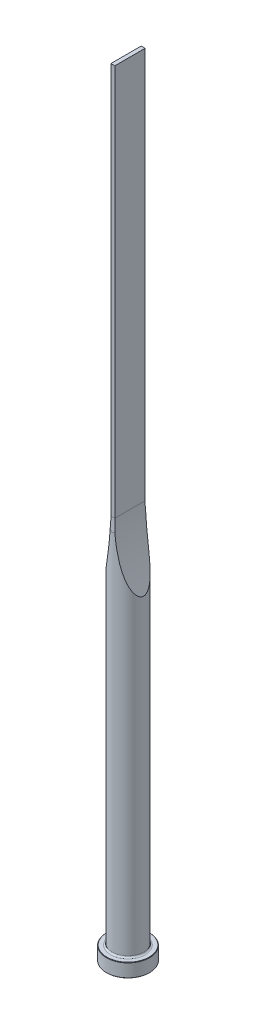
ISO-10303-21;
HEADER;
FILE_DESCRIPTION(('STEP AP214'),'2;1');
FILE_NAME('part.step','',(''),(''),'','','');
FILE_SCHEMA(('AUTOMOTIVE_DESIGN { 1 0 10303 214 1 1 1 1 }'));
ENDSEC;
DATA;
#1=APPLICATION_CONTEXT('core data for automotive mechanical design processes');
#2=APPLICATION_PROTOCOL_DEFINITION('international standard','automotive_design',2000,#1);
#3=PRODUCT_CONTEXT('',#1,'mechanical');
#4=PRODUCT('Part','Part','',(#3));
#5=PRODUCT_RELATED_PRODUCT_CATEGORY('part','',(#4));
#6=PRODUCT_DEFINITION_FORMATION('','',#4);
#7=PRODUCT_DEFINITION_CONTEXT('part definition',#1,'design');
#8=PRODUCT_DEFINITION('design','',#6,#7);
#9=PRODUCT_DEFINITION_SHAPE('','',#8);
#10=(LENGTH_UNIT() NAMED_UNIT(*) SI_UNIT(.MILLI.,.METRE.));
#11=(NAMED_UNIT(*) PLANE_ANGLE_UNIT() SI_UNIT($,.RADIAN.));
#12=(NAMED_UNIT(*) SI_UNIT($,.STERADIAN.) SOLID_ANGLE_UNIT());
#13=UNCERTAINTY_MEASURE_WITH_UNIT(LENGTH_MEASURE(1.E-05),#10,'distance_accuracy_value','');
#14=(GEOMETRIC_REPRESENTATION_CONTEXT(3) GLOBAL_UNCERTAINTY_ASSIGNED_CONTEXT((#13)) GLOBAL_UNIT_ASSIGNED_CONTEXT((#10,
#11,#12)) REPRESENTATION_CONTEXT('',''));
#15=CARTESIAN_POINT('',(0.,0.,0.));
#16=DIRECTION('',(0.,0.,1.));
#17=DIRECTION('',(1.,0.,0.));
#18=AXIS2_PLACEMENT_3D('',#15,#16,#17);
#19=CARTESIAN_POINT('',(0.,0.,0.));
#20=DIRECTION('',(0.,1.,0.));
#21=DIRECTION('',(-1.,0.,0.));
#22=AXIS2_PLACEMENT_3D('',#19,#20,#21);
#23=PLANE('',#22);
#24=CARTESIAN_POINT('',(0.,0.,0.));
#25=DIRECTION('',(0.,1.,0.));
#26=DIRECTION('',(-1.,0.,0.));
#27=AXIS2_PLACEMENT_3D('',#24,#25,#26);
#28=CIRCLE('',#27,10.8);
#29=CARTESIAN_POINT('',(-10.8,0.,0.));
#30=VERTEX_POINT('',#29);
#31=EDGE_CURVE('E133',#30,#30,#28,.T.);
#32=ORIENTED_EDGE('',*,*,#31,.F.);
#33=EDGE_LOOP('',(#32));
#34=FACE_BOUND('',#33,.T.);
#35=ADVANCED_FACE('F32',(#34),#23,.F.);
#36=CARTESIAN_POINT('',(0.,0.,0.));
#37=DIRECTION('',(0.,1.,0.));
#38=DIRECTION('',(-1.,0.,0.));
#39=AXIS2_PLACEMENT_3D('',#36,#37,#38);
#40=CONICAL_SURFACE('',#39,10.8,0.785398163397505);
#41=CARTESIAN_POINT('',(0.,0.199999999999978,0.));
#42=DIRECTION('',(0.,1.,0.));
#43=DIRECTION('',(-1.,0.,0.));
#44=AXIS2_PLACEMENT_3D('',#41,#42,#43);
#45=CIRCLE('',#44,11.);
#46=CARTESIAN_POINT('',(-11.,0.199999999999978,0.));
#47=VERTEX_POINT('',#46);
#48=EDGE_CURVE('E130',#47,#47,#45,.T.);
#49=ORIENTED_EDGE('',*,*,#48,.F.);
#50=EDGE_LOOP('',(#49));
#51=FACE_BOUND('',#50,.T.);
#52=ORIENTED_EDGE('',*,*,#31,.T.);
#53=EDGE_LOOP('',(#52));
#54=FACE_BOUND('',#53,.T.);
#55=ADVANCED_FACE('F171',(#51,#54),#40,.T.);
#56=CARTESIAN_POINT('',(0.,400.,0.));
#57=DIRECTION('',(0.,1.,0.));
#58=DIRECTION('',(-1.,0.,0.));
#59=AXIS2_PLACEMENT_3D('',#56,#57,#58);
#60=CYLINDRICAL_SURFACE('',#59,11.);
#61=CARTESIAN_POINT('',(0.,6.80000000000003,0.));
#62=DIRECTION('',(0.,1.,0.));
#63=DIRECTION('',(-1.,0.,0.));
#64=AXIS2_PLACEMENT_3D('',#61,#62,#63);
#65=CIRCLE('',#64,11.);
#66=CARTESIAN_POINT('',(-11.,6.80000000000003,0.));
#67=VERTEX_POINT('',#66);
#68=EDGE_CURVE('E127',#67,#67,#65,.T.);
#69=ORIENTED_EDGE('',*,*,#68,.F.);
#70=EDGE_LOOP('',(#69));
#71=FACE_BOUND('',#70,.T.);
#72=ORIENTED_EDGE('',*,*,#48,.T.);
#73=EDGE_LOOP('',(#72));
#74=FACE_BOUND('',#73,.T.);
#75=ADVANCED_FACE('F176',(#71,#74),#60,.T.);
#76=CARTESIAN_POINT('',(0.,6.80000000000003,0.));
#77=DIRECTION('',(0.,-1.,0.));
#78=DIRECTION('',(1.,0.,0.));
#79=AXIS2_PLACEMENT_3D('',#76,#77,#78);
#80=CONICAL_SURFACE('',#79,11.,0.785398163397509);
#81=CARTESIAN_POINT('',(0.,7.00000000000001,0.));
#82=DIRECTION('',(0.,1.,0.));
#83=DIRECTION('',(-1.,0.,0.));
#84=AXIS2_PLACEMENT_3D('',#81,#82,#83);
#85=CIRCLE('',#84,10.8);
#86=CARTESIAN_POINT('',(-10.8,7.00000000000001,0.));
#87=VERTEX_POINT('',#86);
#88=EDGE_CURVE('E124',#87,#87,#85,.T.);
#89=ORIENTED_EDGE('',*,*,#88,.F.);
#90=EDGE_LOOP('',(#89));
#91=FACE_BOUND('',#90,.T.);
#92=ORIENTED_EDGE('',*,*,#68,.T.);
#93=EDGE_LOOP('',(#92));
#94=FACE_BOUND('',#93,.T.);
#95=ADVANCED_FACE('F183',(#91,#94),#80,.T.);
#96=CARTESIAN_POINT('',(10.8,7.,0.));
#97=DIRECTION('',(0.,-1.,0.));
#98=DIRECTION('',(1.,0.,0.));
#99=AXIS2_PLACEMENT_3D('',#96,#97,#98);
#100=PLANE('',#99);
#101=CARTESIAN_POINT('',(0.,7.00000000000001,0.));
#102=DIRECTION('',(0.,1.,0.));
#103=DIRECTION('',(-1.,0.,0.));
#104=AXIS2_PLACEMENT_3D('',#101,#102,#103);
#105=CIRCLE('',#104,8.80000000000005);
#106=CARTESIAN_POINT('',(-8.80000000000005,7.00000000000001,0.));
#107=VERTEX_POINT('',#106);
#108=EDGE_CURVE('E121',#107,#107,#105,.T.);
#109=ORIENTED_EDGE('',*,*,#108,.F.);
#110=EDGE_LOOP('',(#109));
#111=FACE_BOUND('',#110,.T.);
#112=ORIENTED_EDGE('',*,*,#88,.T.);
#113=EDGE_LOOP('',(#112));
#114=FACE_BOUND('',#113,.T.);
#115=ADVANCED_FACE('F190',(#111,#114),#100,.F.);
#116=CARTESIAN_POINT('',(0.,7.8,0.));
#117=DIRECTION('',(0.,1.,0.));
#118=DIRECTION('',(-1.,0.,0.));
#119=AXIS2_PLACEMENT_3D('',#116,#117,#118);
#120=TOROIDAL_SURFACE('',#119,8.80000000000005,0.8);
#121=CARTESIAN_POINT('',(0.,7.79999999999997,0.));
#122=DIRECTION('',(0.,1.,0.));
#123=DIRECTION('',(-1.,0.,0.));
#124=AXIS2_PLACEMENT_3D('',#121,#122,#123);
#125=CIRCLE('',#124,8.00000000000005);
#126=CARTESIAN_POINT('',(-8.00000000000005,7.79999999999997,0.));
#127=VERTEX_POINT('',#126);
#128=EDGE_CURVE('E112',#127,#127,#125,.T.);
#129=ORIENTED_EDGE('',*,*,#128,.F.);
#130=EDGE_LOOP('',(#129));
#131=FACE_BOUND('',#130,.T.);
#132=ORIENTED_EDGE('',*,*,#108,.T.);
#133=EDGE_LOOP('',(#132));
#134=FACE_BOUND('',#133,.T.);
#135=ADVANCED_FACE('F168',(#131,#134),#120,.F.);
#136=CARTESIAN_POINT('',(0.,400.,0.));
#137=DIRECTION('',(0.,1.,0.));
#138=DIRECTION('',(-1.,0.,0.));
#139=AXIS2_PLACEMENT_3D('',#136,#137,#138);
#140=CYLINDRICAL_SURFACE('',#139,8.00000000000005);
#141=CARTESIAN_POINT('',(8.00000000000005,165.200574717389,0.));
#142=CARTESIAN_POINT('',(7.9999996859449,165.200575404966,0.0951898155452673));
#143=CARTESIAN_POINT('',(7.99829512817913,165.204640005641,0.190388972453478));
#144=CARTESIAN_POINT('',(7.99153454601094,165.220771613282,0.38000300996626));
#145=CARTESIAN_POINT('',(7.98647695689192,165.232842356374,0.474417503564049));
#146=CARTESIAN_POINT('',(7.96644485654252,165.28069705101,0.755625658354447));
#147=CARTESIAN_POINT('',(7.94661141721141,165.32812258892,0.940195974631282));
#148=CARTESIAN_POINT('',(7.89043863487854,165.462960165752,1.33784788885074));
#149=CARTESIAN_POINT('',(7.85143072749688,165.556866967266,1.54828766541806));
#150=CARTESIAN_POINT('',(7.76144530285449,165.77490910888,1.95001230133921));
#151=CARTESIAN_POINT('',(7.7104478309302,165.89909485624,2.14126446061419));
#152=CARTESIAN_POINT('',(7.6116621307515,166.141491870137,2.46682573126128));
#153=CARTESIAN_POINT('',(7.56539596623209,166.255615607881,2.60472561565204));
#154=CARTESIAN_POINT('',(7.46905337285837,166.494812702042,2.86933440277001));
#155=CARTESIAN_POINT('',(7.41897455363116,166.61989293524,2.99603617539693));
#156=CARTESIAN_POINT('',(7.31603232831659,166.878813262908,3.23931243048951));
#157=CARTESIAN_POINT('',(7.2631644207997,167.012667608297,3.35586968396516));
#158=CARTESIAN_POINT('',(7.15551047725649,167.287260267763,3.57967746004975));
#159=CARTESIAN_POINT('',(7.10072369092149,167.428001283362,3.68692428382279));
#160=CARTESIAN_POINT('',(6.99000672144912,167.714638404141,3.89274038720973));
#161=CARTESIAN_POINT('',(6.9340797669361,167.860520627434,3.99133084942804));
#162=CARTESIAN_POINT('',(6.82140223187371,168.15680857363,4.1809830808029));
#163=CARTESIAN_POINT('',(6.76465148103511,168.307215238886,4.27204326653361));
#164=CARTESIAN_POINT('',(6.59364355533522,168.764240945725,4.53517276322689));
#165=CARTESIAN_POINT('',(6.4787015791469,169.076482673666,4.69706305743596));
#166=CARTESIAN_POINT('',(6.24883926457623,169.712124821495,4.998797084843));
#167=CARTESIAN_POINT('',(6.13391945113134,170.035546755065,5.13859505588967));
#168=CARTESIAN_POINT('',(5.96268993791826,170.526520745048,5.33420973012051));
#169=CARTESIAN_POINT('',(5.90581545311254,170.691121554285,5.39705734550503));
#170=CARTESIAN_POINT('',(5.79254575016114,171.022071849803,5.51845204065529));
#171=CARTESIAN_POINT('',(5.73615054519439,171.188421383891,5.5769990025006));
#172=CARTESIAN_POINT('',(5.59290285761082,171.615097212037,5.72143005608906));
#173=CARTESIAN_POINT('',(5.50645869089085,171.876507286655,5.8045214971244));
#174=CARTESIAN_POINT('',(5.33524655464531,172.402418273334,5.96227192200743));
#175=CARTESIAN_POINT('',(5.25047876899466,172.666919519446,6.03692998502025));
#176=CARTESIAN_POINT('',(5.08280932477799,173.198618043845,6.17876308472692));
#177=CARTESIAN_POINT('',(4.99990838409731,173.465816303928,6.24593528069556));
#178=CARTESIAN_POINT('',(4.83616806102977,174.002446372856,6.37355758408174));
#179=CARTESIAN_POINT('',(4.75532879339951,174.27187830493,6.43400731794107));
#180=CARTESIAN_POINT('',(4.5158237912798,175.084019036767,6.6065282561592));
#181=CARTESIAN_POINT('',(4.3604637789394,175.629644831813,6.70952926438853));
#182=CARTESIAN_POINT('',(4.05935063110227,176.726686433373,6.89586397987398));
#183=CARTESIAN_POINT('',(3.91359581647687,177.278101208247,6.97920113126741));
#184=CARTESIAN_POINT('',(3.63139933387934,178.388488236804,7.13012375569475));
#185=CARTESIAN_POINT('',(3.4950091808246,178.947484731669,7.19762637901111));
#186=CARTESIAN_POINT('',(3.23268287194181,180.069371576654,7.31919695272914));
#187=CARTESIAN_POINT('',(3.10674701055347,180.632262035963,7.37326452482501));
#188=CARTESIAN_POINT('',(2.86565816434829,181.760745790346,7.47026525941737));
#189=CARTESIAN_POINT('',(2.7504954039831,182.326336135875,7.51320857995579));
#190=CARTESIAN_POINT('',(2.53096880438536,183.460229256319,7.58997438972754));
#191=CARTESIAN_POINT('',(2.4266052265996,184.028532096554,7.62379665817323));
#192=CARTESIAN_POINT('',(2.22464626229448,185.191247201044,7.68521631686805));
#193=CARTESIAN_POINT('',(2.1275167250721,185.785757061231,7.71249406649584));
#194=CARTESIAN_POINT('',(1.94517731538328,186.976882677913,7.76048765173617));
#195=CARTESIAN_POINT('',(1.85996788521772,187.57349851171,7.78120324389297));
#196=CARTESIAN_POINT('',(1.70152266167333,188.768556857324,7.81737954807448));
#197=CARTESIAN_POINT('',(1.62828851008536,189.36699960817,7.83283953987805));
#198=CARTESIAN_POINT('',(1.49385218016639,190.565328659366,7.85958657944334));
#199=CARTESIAN_POINT('',(1.43265005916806,191.165214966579,7.8708736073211));
#200=CARTESIAN_POINT('',(1.32225717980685,192.366733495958,7.89016969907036));
#201=CARTESIAN_POINT('',(1.27307820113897,192.968366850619,7.89817555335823));
#202=CARTESIAN_POINT('',(1.18683300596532,194.172530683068,7.91159474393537));
#203=CARTESIAN_POINT('',(1.14976682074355,194.77506116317,7.91700807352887));
#204=CARTESIAN_POINT('',(1.08776652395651,195.980719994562,7.92576455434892));
#205=CARTESIAN_POINT('',(1.06283159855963,196.583848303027,7.92910784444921));
#206=CARTESIAN_POINT('',(1.02510116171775,197.790490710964,7.93407395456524));
#207=CARTESIAN_POINT('',(1.01230563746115,198.39400481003,7.93569677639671));
#208=CARTESIAN_POINT('',(0.998864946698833,199.600680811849,7.93739973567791));
#209=CARTESIAN_POINT('',(0.998209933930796,200.203842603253,7.93748112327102));
#210=CARTESIAN_POINT('',(1.00902540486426,201.410056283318,7.93611350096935));
#211=CARTESIAN_POINT('',(1.02049589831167,202.013108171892,7.93466448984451));
#212=CARTESIAN_POINT('',(1.05555842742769,203.218886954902,7.93007624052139));
#213=CARTESIAN_POINT('',(1.07915113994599,203.821613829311,7.92693690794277));
#214=CARTESIAN_POINT('',(1.13844803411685,205.026456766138,7.91863830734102));
#215=CARTESIAN_POINT('',(1.17415218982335,205.628572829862,7.91347904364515));
#216=CARTESIAN_POINT('',(1.25761963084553,206.831420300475,7.90064394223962));
#217=CARTESIAN_POINT('',(1.30537248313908,207.432152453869,7.89297028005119));
#218=CARTESIAN_POINT('',(1.41292919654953,208.632487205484,7.87442760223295));
#219=CARTESIAN_POINT('',(1.47273302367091,209.232089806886,7.86355859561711));
#220=CARTESIAN_POINT('',(1.60435274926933,210.429821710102,7.83776437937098));
#221=CARTESIAN_POINT('',(1.67616729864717,211.027951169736,7.82283962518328));
#222=CARTESIAN_POINT('',(1.8317679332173,212.222485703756,7.78787433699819));
#223=CARTESIAN_POINT('',(1.91555365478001,212.818890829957,7.76783395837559));
#224=CARTESIAN_POINT('',(2.09527994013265,214.011253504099,7.721298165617));
#225=CARTESIAN_POINT('',(2.19125242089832,214.607205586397,7.69478562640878));
#226=CARTESIAN_POINT('',(2.39509132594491,215.796652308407,7.63379718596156));
#227=CARTESIAN_POINT('',(2.50295739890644,216.390147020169,7.59932151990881));
#228=CARTESIAN_POINT('',(2.73054263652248,217.574606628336,7.52054876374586));
#229=CARTESIAN_POINT('',(2.85026925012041,218.165569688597,7.4762454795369));
#230=CARTESIAN_POINT('',(3.10135018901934,219.343998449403,7.37563070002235));
#231=CARTESIAN_POINT('',(3.23270432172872,219.931464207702,7.3193194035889));
#232=CARTESIAN_POINT('',(3.50633260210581,221.100167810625,7.19224086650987));
#233=CARTESIAN_POINT('',(3.64856803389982,221.681420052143,7.12152351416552));
#234=CARTESIAN_POINT('',(3.94400085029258,222.838777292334,6.96225785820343));
#235=CARTESIAN_POINT('',(4.09719959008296,223.414881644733,6.87370734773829));
#236=CARTESIAN_POINT('',(4.41379154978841,224.559734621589,6.67483610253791));
#237=CARTESIAN_POINT('',(4.57717072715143,225.128492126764,6.56454492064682));
#238=CARTESIAN_POINT('',(4.82930445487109,225.974949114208,6.37876498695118));
#239=CARTESIAN_POINT('',(4.9145162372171,226.255956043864,6.31345656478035));
#240=CARTESIAN_POINT('',(5.08713730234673,226.815399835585,6.17521536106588));
#241=CARTESIAN_POINT('',(5.17454640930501,227.093836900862,6.10228318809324));
#242=CARTESIAN_POINT('',(5.32140384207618,227.553858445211,5.9740000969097));
#243=CARTESIAN_POINT('',(5.38029215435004,227.736296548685,5.92106403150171));
#244=CARTESIAN_POINT('',(5.49886094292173,228.099675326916,5.81111513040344));
#245=CARTESIAN_POINT('',(5.55854140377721,228.28061603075,5.75410237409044));
#246=CARTESIAN_POINT('',(5.73867731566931,228.821016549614,5.57638921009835));
#247=CARTESIAN_POINT('',(5.86020024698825,229.177970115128,5.44903714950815));
#248=CARTESIAN_POINT('',(6.10470062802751,229.881872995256,5.17363421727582));
#249=CARTESIAN_POINT('',(6.22767165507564,230.228852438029,5.02565587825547));
#250=CARTESIAN_POINT('',(6.41230815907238,230.740125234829,4.78460865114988));
#251=CARTESIAN_POINT('',(6.47387012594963,230.908980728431,4.70110003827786));
#252=CARTESIAN_POINT('',(6.59678680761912,231.243067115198,4.52700525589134));
#253=CARTESIAN_POINT('',(6.65814155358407,231.408298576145,4.43642020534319));
#254=CARTESIAN_POINT('',(6.77281683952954,231.714428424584,4.25895492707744));
#255=CARTESIAN_POINT('',(6.8262005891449,231.855827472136,4.17298092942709));
#256=CARTESIAN_POINT('',(6.93224266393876,232.134629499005,3.9943466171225));
#257=CARTESIAN_POINT('',(6.98490101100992,232.272032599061,3.90168650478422));
#258=CARTESIAN_POINT('',(7.08925706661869,232.542407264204,3.70870602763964));
#259=CARTESIAN_POINT('',(7.14095162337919,232.675365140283,3.608364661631));
#260=CARTESIAN_POINT('',(7.24271906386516,232.935351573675,3.39948932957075));
#261=CARTESIAN_POINT('',(7.29279197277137,233.06238022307,3.29095549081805));
#262=CARTESIAN_POINT('',(7.39144636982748,233.31107760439,3.06303123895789));
#263=CARTESIAN_POINT('',(7.43999201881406,233.432630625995,2.94349693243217));
#264=CARTESIAN_POINT('',(7.53381793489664,233.666190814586,2.69432317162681));
#265=CARTESIAN_POINT('',(7.57909710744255,233.778194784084,2.56468036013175));
#266=CARTESIAN_POINT('',(7.70793180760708,234.095197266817,2.16037788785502));
#267=CARTESIAN_POINT('',(7.78519729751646,234.282972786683,1.86879216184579));
#268=CARTESIAN_POINT('',(7.88033493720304,234.512738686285,1.38899625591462));
#269=CARTESIAN_POINT('',(7.90910974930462,234.58189769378,1.21587879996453));
#270=CARTESIAN_POINT('',(7.95568575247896,234.693594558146,0.859756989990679));
#271=CARTESIAN_POINT('',(7.97349730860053,234.736157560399,0.676762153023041));
#272=CARTESIAN_POINT('',(7.99640047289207,234.790852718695,0.30424013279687));
#273=CARTESIAN_POINT('',(8.00141393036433,234.802797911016,0.114679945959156));
#274=CARTESIAN_POINT('',(7.99789292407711,234.794399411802,-0.263610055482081));
#275=CARTESIAN_POINT('',(7.98935682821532,234.774051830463,-0.452339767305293));
#276=CARTESIAN_POINT('',(7.96081303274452,234.705829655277,-0.809502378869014));
#277=CARTESIAN_POINT('',(7.94167563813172,234.660042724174,-0.978418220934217));
#278=CARTESIAN_POINT('',(7.89424584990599,234.546163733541,-1.3070993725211));
#279=CARTESIAN_POINT('',(7.86594930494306,234.478061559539,-1.46686049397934));
#280=CARTESIAN_POINT('',(7.78372128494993,234.279265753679,-1.86420721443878));
#281=CARTESIAN_POINT('',(7.72439416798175,234.135073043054,-2.09389183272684));
#282=CARTESIAN_POINT('',(7.593976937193,233.815163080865,-2.52644457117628));
#283=CARTESIAN_POINT('',(7.52285251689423,233.639353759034,-2.72923128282));
#284=CARTESIAN_POINT('',(7.38255555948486,233.28895057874,-3.08707888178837));
#285=CARTESIAN_POINT('',(7.31420744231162,233.116835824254,-3.24494358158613));
#286=CARTESIAN_POINT('',(7.17393251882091,232.760146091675,-3.54429794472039));
#287=CARTESIAN_POINT('',(7.10200284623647,232.575561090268,-3.68577418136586));
#288=CARTESIAN_POINT('',(6.95590090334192,232.19675017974,-3.95460160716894));
#289=CARTESIAN_POINT('',(6.88172471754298,232.002507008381,-4.08192608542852));
#290=CARTESIAN_POINT('',(6.73227144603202,231.606876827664,-4.32397115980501));
#291=CARTESIAN_POINT('',(6.65699468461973,231.405491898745,-4.43869538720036));
#292=CARTESIAN_POINT('',(6.47952844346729,230.92533498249,-4.69552369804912));
#293=CARTESIAN_POINT('',(6.37716733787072,230.644212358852,-4.83310281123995));
#294=CARTESIAN_POINT('',(6.17288514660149,230.074115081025,-5.09142149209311));
#295=CARTESIAN_POINT('',(6.07096426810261,229.785137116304,-5.21215382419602));
#296=CARTESIAN_POINT('',(5.86824674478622,229.200692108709,-5.43938317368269));
#297=CARTESIAN_POINT('',(5.7674521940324,228.905215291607,-5.54585675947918));
#298=CARTESIAN_POINT('',(5.5677451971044,228.309513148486,-5.74632195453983));
#299=CARTESIAN_POINT('',(5.46883248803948,228.009288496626,-5.84031531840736));
#300=CARTESIAN_POINT('',(5.27282470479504,227.403526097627,-6.01788020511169));
#301=CARTESIAN_POINT('',(5.17574034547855,227.0979700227,-6.1014007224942));
#302=CARTESIAN_POINT('',(4.98417270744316,226.483598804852,-6.25886492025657));
#303=CARTESIAN_POINT('',(4.88968948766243,226.174783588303,-6.33280838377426));
#304=CARTESIAN_POINT('',(4.70363882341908,225.554700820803,-6.47219266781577));
#305=CARTESIAN_POINT('',(4.61206878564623,225.243435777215,-6.53764122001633));
#306=CARTESIAN_POINT('',(4.4319252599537,224.618573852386,-6.66107734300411));
#307=CARTESIAN_POINT('',(4.34335180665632,224.304976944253,-6.71906482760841));
#308=CARTESIAN_POINT('',(4.12841382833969,223.527809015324,-6.8541272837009));
#309=CARTESIAN_POINT('',(4.00386624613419,223.063064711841,-6.927353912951));
#310=CARTESIAN_POINT('',(3.76184032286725,222.129976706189,-7.06170615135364));
#311=CARTESIAN_POINT('',(3.64436267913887,221.661632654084,-7.12283056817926));
#312=CARTESIAN_POINT('',(3.41666459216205,220.721805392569,-7.23481178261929));
#313=CARTESIAN_POINT('',(3.30644657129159,220.250321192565,-7.28566516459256));
#314=CARTESIAN_POINT('',(3.09346099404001,219.304799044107,-7.37861740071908));
#315=CARTESIAN_POINT('',(2.99069379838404,218.830760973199,-7.42071583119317));
#316=CARTESIAN_POINT('',(2.79255626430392,217.879687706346,-7.49752866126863));
#317=CARTESIAN_POINT('',(2.69719907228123,217.402648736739,-7.5322301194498));
#318=CARTESIAN_POINT('',(2.51416019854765,216.446671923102,-7.59528568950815));
#319=CARTESIAN_POINT('',(2.42647875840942,215.967734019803,-7.62363960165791));
#320=CARTESIAN_POINT('',(2.25887310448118,215.008314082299,-7.67497072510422));
#321=CARTESIAN_POINT('',(2.17894737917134,214.527832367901,-7.69794898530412));
#322=CARTESIAN_POINT('',(2.0268794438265,213.565440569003,-7.73937658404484));
#323=CARTESIAN_POINT('',(1.95473741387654,213.083530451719,-7.75782581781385));
#324=CARTESIAN_POINT('',(1.74970689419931,211.633559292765,-7.80759135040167));
#325=CARTESIAN_POINT('',(1.6286243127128,210.66360542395,-7.83320749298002));
#326=CARTESIAN_POINT('',(1.41810393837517,208.720061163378,-7.87403437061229));
#327=CARTESIAN_POINT('',(1.32866717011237,207.746470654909,-7.889244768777));
#328=CARTESIAN_POINT('',(1.18163064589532,205.797783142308,-7.91260337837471));
#329=CARTESIAN_POINT('',(1.12399909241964,204.822688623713,-7.92075864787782));
#330=CARTESIAN_POINT('',(1.04050604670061,202.87112630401,-7.93215646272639));
#331=CARTESIAN_POINT('',(1.01464433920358,201.894658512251,-7.93539904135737));
#332=CARTESIAN_POINT('',(0.993960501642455,199.866933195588,-7.93802255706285));
#333=CARTESIAN_POINT('',(1.0016547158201,198.815648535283,-7.93709028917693));
#334=CARTESIAN_POINT('',(1.05386528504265,196.713991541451,-7.93032404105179));
#335=CARTESIAN_POINT('',(1.09838262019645,195.663619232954,-7.92448993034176));
#336=CARTESIAN_POINT('',(1.22425539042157,193.563934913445,-7.9060297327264));
#337=CARTESIAN_POINT('',(1.30565178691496,192.514625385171,-7.89339609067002));
#338=CARTESIAN_POINT('',(1.45528326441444,190.943481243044,-7.86667893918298));
#339=CARTESIAN_POINT('',(1.50975015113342,190.420234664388,-7.85647872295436));
#340=CARTESIAN_POINT('',(1.62784054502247,189.374851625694,-7.83286557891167));
#341=CARTESIAN_POINT('',(1.69146386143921,188.852715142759,-7.81945271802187));
#342=CARTESIAN_POINT('',(1.82736746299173,187.813351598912,-7.78880876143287));
#343=CARTESIAN_POINT('',(1.8995849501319,187.296115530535,-7.77160466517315));
#344=CARTESIAN_POINT('',(2.05298255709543,186.263162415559,-7.73249834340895));
#345=CARTESIAN_POINT('',(2.13416245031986,185.747445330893,-7.71059623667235));
#346=CARTESIAN_POINT('',(2.3054555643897,184.717647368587,-7.6611242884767));
#347=CARTESIAN_POINT('',(2.39557077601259,184.20356688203,-7.63355318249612));
#348=CARTESIAN_POINT('',(2.58465162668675,183.177445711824,-7.57162306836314));
#349=CARTESIAN_POINT('',(2.68361718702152,182.665405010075,-7.53726412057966));
#350=CARTESIAN_POINT('',(2.89011341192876,181.644659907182,-7.46051995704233));
#351=CARTESIAN_POINT('',(2.99762759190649,181.135951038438,-7.41814998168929));
#352=CARTESIAN_POINT('',(3.2212624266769,180.121289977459,-7.323810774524));
#353=CARTESIAN_POINT('',(3.33738341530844,179.61533789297,-7.27184117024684));
#354=CARTESIAN_POINT('',(3.57799451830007,178.60697528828,-7.1565179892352));
#355=CARTESIAN_POINT('',(3.70248069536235,178.10456322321,-7.09316974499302));
#356=CARTESIAN_POINT('',(3.9596116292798,177.103764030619,-6.95290946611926));
#357=CARTESIAN_POINT('',(4.09225533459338,176.605376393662,-6.87599917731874));
#358=CARTESIAN_POINT('',(4.27445498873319,175.943619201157,-6.76253743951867));
#359=CARTESIAN_POINT('',(4.32055424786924,175.778043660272,-6.73319330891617));
#360=CARTESIAN_POINT('',(4.41360552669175,175.447489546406,-6.67256862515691));
#361=CARTESIAN_POINT('',(4.46055753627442,175.282510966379,-6.64128809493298));
#362=CARTESIAN_POINT('',(4.60266899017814,174.788522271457,-6.54435661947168));
#363=CARTESIAN_POINT('',(4.69908104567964,174.460469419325,-6.4756175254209));
#364=CARTESIAN_POINT('',(4.89528849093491,173.806576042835,-6.32860339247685));
#365=CARTESIAN_POINT('',(4.99509178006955,173.480743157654,-6.25030480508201));
#366=CARTESIAN_POINT('',(5.19757687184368,172.832751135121,-6.08296344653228));
#367=CARTESIAN_POINT('',(5.30025857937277,172.510591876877,-5.99392103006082));
#368=CARTESIAN_POINT('',(5.52510687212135,171.818522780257,-5.78792965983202));
#369=CARTESIAN_POINT('',(5.64771898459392,171.449398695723,-5.6687978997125));
#370=CARTESIAN_POINT('',(5.89557187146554,170.718859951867,-5.41057194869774));
#371=CARTESIAN_POINT('',(6.0208137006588,170.357448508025,-5.27146961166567));
#372=CARTESIAN_POINT('',(6.27217794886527,169.646457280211,-4.96973910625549));
#373=CARTESIAN_POINT('',(6.39829525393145,169.296837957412,-4.80720179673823));
#374=CARTESIAN_POINT('',(6.586855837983,168.783747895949,-4.54147910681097));
#375=CARTESIAN_POINT('',(6.64958449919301,168.614666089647,-4.44928894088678));
#376=CARTESIAN_POINT('',(6.77447567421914,168.281035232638,-4.25672096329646));
#377=CARTESIAN_POINT('',(6.83663831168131,168.116485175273,-4.15634498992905));
#378=CARTESIAN_POINT('',(6.94405120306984,167.834583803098,-3.97345109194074));
#379=CARTESIAN_POINT('',(6.98953447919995,167.715989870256,-3.89299059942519));
#380=CARTESIAN_POINT('',(7.07966167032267,167.482427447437,-3.72657104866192));
#381=CARTESIAN_POINT('',(7.12430560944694,167.367458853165,-3.64061214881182));
#382=CARTESIAN_POINT('',(7.25670307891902,167.028515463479,-3.37342059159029));
#383=CARTESIAN_POINT('',(7.342806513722,166.81080616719,-3.18306526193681));
#384=CARTESIAN_POINT('',(7.46632416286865,166.501677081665,-2.8751247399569));
#385=CARTESIAN_POINT('',(7.50678239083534,166.400989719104,-2.76803236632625));
#386=CARTESIAN_POINT('',(7.58493975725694,166.207417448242,-2.54609245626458));
#387=CARTESIAN_POINT('',(7.62263834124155,166.11453410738,-2.43124337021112));
#388=CARTESIAN_POINT('',(7.73022265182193,165.850624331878,-2.07483501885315));
#389=CARTESIAN_POINT('',(7.79494270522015,165.693476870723,-1.82059217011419));
#390=CARTESIAN_POINT('',(7.88178671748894,165.483764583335,-1.38106361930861));
#391=CARTESIAN_POINT('',(7.91080089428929,165.414040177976,-1.20529404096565));
#392=CARTESIAN_POINT('',(7.95743556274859,165.302216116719,-0.843869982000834));
#393=CARTESIAN_POINT('',(7.97508793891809,165.260039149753,-0.658244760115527));
#394=CARTESIAN_POINT('',(7.99075240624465,165.222637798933,-0.392445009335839));
#395=CARTESIAN_POINT('',(7.99421164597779,165.214383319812,-0.314251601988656));
#396=CARTESIAN_POINT('',(7.99883587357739,165.203350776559,-0.157374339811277));
#397=CARTESIAN_POINT('',(8.00000025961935,165.200574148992,-0.0786903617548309));
#398=CARTESIAN_POINT('',(8.00000000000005,165.200574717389,0.));
#399=B_SPLINE_CURVE_WITH_KNOTS('',3,(#141,#142,#143,#144,#145,#146,#147,#148,#149,#150,#151,
#152,#153,#154,#155,#156,#157,#158,#159,#160,#161,#162,#163,#164,#165,#166,#167,#168,#169,#170,
#171,#172,#173,#174,#175,#176,#177,#178,#179,#180,#181,#182,#183,#184,#185,#186,#187,#188,#189,
#190,#191,#192,#193,#194,#195,#196,#197,#198,#199,#200,#201,#202,#203,#204,#205,#206,#207,#208,
#209,#210,#211,#212,#213,#214,#215,#216,#217,#218,#219,#220,#221,#222,#223,#224,#225,#226,#227,
#228,#229,#230,#231,#232,#233,#234,#235,#236,#237,#238,#239,#240,#241,#242,#243,#244,#245,#246,
#247,#248,#249,#250,#251,#252,#253,#254,#255,#256,#257,#258,#259,#260,#261,#262,#263,#264,#265,
#266,#267,#268,#269,#270,#271,#272,#273,#274,#275,#276,#277,#278,#279,#280,#281,#282,#283,#284,
#285,#286,#287,#288,#289,#290,#291,#292,#293,#294,#295,#296,#297,#298,#299,#300,#301,#302,#303,
#304,#305,#306,#307,#308,#309,#310,#311,#312,#313,#314,#315,#316,#317,#318,#319,#320,#321,#322,
#323,#324,#325,#326,#327,#328,#329,#330,#331,#332,#333,#334,#335,#336,#337,#338,#339,#340,#341,
#342,#343,#344,#345,#346,#347,#348,#349,#350,#351,#352,#353,#354,#355,#356,#357,#358,#359,#360,
#361,#362,#363,#364,#365,#366,#367,#368,#369,#370,#371,#372,#373,#374,#375,#376,#377,#378,#379,
#380,#381,#382,#383,#384,#385,#386,#387,#388,#389,#390,#391,#392,#393,#394,#395,#396,#397,#398),
.UNSPECIFIED.,.T.,.F.,(4,2,2,2,2,2,2,2,2,2,2,2,2,2,2,2,2,2,2,2,2,2,2,2,2,2,2,2,2,2,2,2,2,2,2,2,
2,2,2,2,2,2,2,2,2,2,2,2,2,2,2,2,2,2,2,2,2,2,2,2,2,2,2,2,2,2,2,2,2,2,2,2,2,2,2,2,2,2,2,2,2,2,2,2,
2,2,2,2,2,2,2,2,2,2,2,2,2,2,2,2,2,2,2,2,2,2,2,2,2,2,2,2,2,2,2,2,2,2,2,2,2,2,2,2,2,2,2,2,4),(0.,
0.285476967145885,0.571087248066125,1.14286351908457,1.8402252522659,2.53875595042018,
3.09264451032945,3.64688324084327,4.20204560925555,4.75742753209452,5.31141014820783,
5.86550895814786,6.97440699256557,8.08557271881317,8.64095204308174,9.19634658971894,
10.0589618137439,10.9216711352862,11.7847067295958,12.6477902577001,14.376962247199,
16.1058311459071,17.8435535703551,19.5813249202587,21.3175037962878,23.053724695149,
24.8625858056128,26.6715140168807,28.480690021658,30.2898746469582,32.1008247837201,
33.9117795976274,35.7226129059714,37.5334443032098,39.342807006,41.1521711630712,
42.9616363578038,44.7710976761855,46.5789975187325,48.3868922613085,50.1945840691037,
52.0022209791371,53.8146936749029,55.6271128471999,57.4406776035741,59.2542123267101,
61.0615703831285,62.8691522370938,64.6742937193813,65.5766552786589,66.4789448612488,
67.0755435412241,67.6721306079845,68.8655800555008,70.0549339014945,70.6493500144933,
71.2436723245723,71.765166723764,72.2866453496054,72.8096044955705,73.3325555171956,
73.8637307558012,74.3950831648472,75.4504562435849,76.0143632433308,76.5777362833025,
77.1445413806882,77.7114147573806,78.2374688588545,78.763761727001,79.5918212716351,
80.4223324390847,81.1513093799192,81.8808793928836,82.6118038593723,83.342517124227,
84.329726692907,85.3173589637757,86.3065948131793,87.2956914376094,88.2894321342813,
89.2831953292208,90.2760476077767,91.2689113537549,92.728701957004,94.18863630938,
95.6490553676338,97.1095450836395,98.5725694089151,100.035639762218,101.498424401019,
102.961242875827,105.894034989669,108.826922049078,111.756871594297,114.686801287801,
117.840072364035,120.993427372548,124.150293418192,125.728737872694,127.307149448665,
128.874664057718,130.442139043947,132.009964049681,133.577775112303,135.142633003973,
136.707551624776,138.271738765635,139.835724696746,140.358794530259,140.881858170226,
141.928017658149,142.976808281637,144.025564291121,145.24544405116,146.465822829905,
147.681591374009,148.289041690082,148.896355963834,149.347280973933,149.79819299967,
150.701144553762,151.158134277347,151.61521556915,152.525694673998,153.097588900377,
153.667871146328,153.90380391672,154.139798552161),.UNSPECIFIED.);
#400=CARTESIAN_POINT('',(1.16475494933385,194.556770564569,-7.91475494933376));
#401=VERTEX_POINT('',#400);
#402=CARTESIAN_POINT('',(1.1647549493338,194.556770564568,7.91475494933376));
#403=VERTEX_POINT('',#402);
#404=EDGE_CURVE('E138',#401,#403,#399,.T.);
#405=ORIENTED_EDGE('',*,*,#404,.T.);
#406=CARTESIAN_POINT('',(-1.98431348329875,200.,7.74999999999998));
#407=CARTESIAN_POINT('',(-1.98431671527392,200.310227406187,7.7500001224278));
#408=CARTESIAN_POINT('',(-1.97807758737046,200.620470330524,7.75160504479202));
#409=CARTESIAN_POINT('',(-1.95278869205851,201.240402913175,7.75801423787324));
#410=CARTESIAN_POINT('',(-1.93373880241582,201.550092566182,7.7628185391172));
#411=CARTESIAN_POINT('',(-1.88170740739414,202.168545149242,7.77559741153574));
#412=CARTESIAN_POINT('',(-1.84871351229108,202.477307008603,7.78357480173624));
#413=CARTESIAN_POINT('',(-1.76661059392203,203.092457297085,7.8026188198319));
#414=CARTESIAN_POINT('',(-1.71750945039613,203.398846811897,7.81368393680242));
#415=CARTESIAN_POINT('',(-1.59923669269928,204.00782620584,7.83876619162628));
#416=CARTESIAN_POINT('',(-1.53006503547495,204.310416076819,7.85278333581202));
#417=CARTESIAN_POINT('',(-1.40509547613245,204.758317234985,7.87574985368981));
#418=CARTESIAN_POINT('',(-1.3599052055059,204.906616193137,7.88372857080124));
#419=CARTESIAN_POINT('',(-1.26052233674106,205.200044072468,7.90023035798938));
#420=CARTESIAN_POINT('',(-1.20633656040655,205.34517530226,7.90875301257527));
#421=CARTESIAN_POINT('',(-1.08563979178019,205.631320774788,7.92623499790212));
#422=CARTESIAN_POINT('',(-1.01906689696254,205.772310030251,7.93519634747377));
#423=CARTESIAN_POINT('',(-0.90591358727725,205.976517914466,7.94863066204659));
#424=CARTESIAN_POINT('',(-0.865970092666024,206.043388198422,7.95310844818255));
#425=CARTESIAN_POINT('',(-0.780477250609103,206.173411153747,7.96195394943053));
#426=CARTESIAN_POINT('',(-0.734935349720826,206.236568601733,7.9663218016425));
#427=CARTESIAN_POINT('',(-0.636093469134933,206.357858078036,7.9748287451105));
#428=CARTESIAN_POINT('',(-0.582709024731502,206.415922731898,7.97896456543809));
#429=CARTESIAN_POINT('',(-0.466606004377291,206.521734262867,7.98659018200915));
#430=CARTESIAN_POINT('',(-0.403961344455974,206.569556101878,7.9900846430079));
#431=CARTESIAN_POINT('',(-0.303890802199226,206.626684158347,7.99429035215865));
#432=CARTESIAN_POINT('',(-0.270535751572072,206.643017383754,7.99549865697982));
#433=CARTESIAN_POINT('',(-0.201689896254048,206.67042162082,7.99753116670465));
#434=CARTESIAN_POINT('',(-0.166200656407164,206.681496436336,7.99835564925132));
#435=CARTESIAN_POINT('',(-0.0934740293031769,206.697347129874,7.9995369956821));
#436=CARTESIAN_POINT('',(-0.0562242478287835,206.702068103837,7.99988978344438));
#437=CARTESIAN_POINT('',(0.0184986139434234,206.704424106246,8.00006574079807));
#438=CARTESIAN_POINT('',(0.0559716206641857,206.702061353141,7.99988907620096));
#439=CARTESIAN_POINT('',(0.126456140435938,206.691099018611,7.99907121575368));
#440=CARTESIAN_POINT('',(0.15956336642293,206.683086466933,7.99847374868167));
#441=CARTESIAN_POINT('',(0.224196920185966,206.662232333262,7.9969233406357));
#442=CARTESIAN_POINT('',(0.255722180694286,206.649387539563,7.99597016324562));
#443=CARTESIAN_POINT('',(0.334694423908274,206.611135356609,7.99314270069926));
#444=CARTESIAN_POINT('',(0.380692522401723,206.582771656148,7.99105553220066));
#445=CARTESIAN_POINT('',(0.467817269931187,206.519390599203,7.98642960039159));
#446=CARTESIAN_POINT('',(0.508928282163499,206.484352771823,7.98388944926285));
#447=CARTESIAN_POINT('',(0.621519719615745,206.376791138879,7.97616511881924));
#448=CARTESIAN_POINT('',(0.687515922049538,206.298628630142,7.97063757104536));
#449=CARTESIAN_POINT('',(0.808549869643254,206.134392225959,7.95926471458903));
#450=CARTESIAN_POINT('',(0.86355384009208,206.048295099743,7.95341849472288));
#451=CARTESIAN_POINT('',(0.9951283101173,205.820249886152,7.93828495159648));
#452=CARTESIAN_POINT('',(1.06569888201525,205.674876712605,7.92896886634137));
#453=CARTESIAN_POINT('',(1.19356521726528,205.378285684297,7.91071942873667));
#454=CARTESIAN_POINT('',(1.25082971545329,205.227055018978,7.90178701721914));
#455=CARTESIAN_POINT('',(1.35570730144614,204.920417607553,7.88447171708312));
#456=CARTESIAN_POINT('',(1.4032696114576,204.764993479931,7.876091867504));
#457=CARTESIAN_POINT('',(1.49048759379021,204.452132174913,7.8600502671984));
#458=CARTESIAN_POINT('',(1.53015172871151,204.29469734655,7.85238775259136));
#459=CARTESIAN_POINT('',(1.62389561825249,203.88790445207,7.83367180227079));
#460=CARTESIAN_POINT('',(1.67325812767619,203.637435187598,7.82318329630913));
#461=CARTESIAN_POINT('',(1.7594800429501,203.134239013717,7.80423839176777));
#462=CARTESIAN_POINT('',(1.79633420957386,202.881511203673,7.79578284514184));
#463=CARTESIAN_POINT('',(1.85947965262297,202.374226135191,7.78096344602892));
#464=CARTESIAN_POINT('',(1.88575180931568,202.119666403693,7.77460338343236));
#465=CARTESIAN_POINT('',(1.92879038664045,201.609697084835,7.76403451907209));
#466=CARTESIAN_POINT('',(1.94555558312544,201.354287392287,7.75982599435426));
#467=CARTESIAN_POINT('',(1.98269985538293,200.587295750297,7.75046498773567));
#468=CARTESIAN_POINT('',(1.98992728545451,200.074954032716,7.74857715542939));
#469=CARTESIAN_POINT('',(1.9752923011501,199.307450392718,7.75230076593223));
#470=CARTESIAN_POINT('',(1.96618074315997,199.051933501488,7.75463124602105));
#471=CARTESIAN_POINT('',(1.93906690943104,198.541399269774,7.76145849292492));
#472=CARTESIAN_POINT('',(1.92106540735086,198.286381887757,7.7659550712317));
#473=CARTESIAN_POINT('',(1.87471171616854,197.76876010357,7.77727743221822));
#474=CARTESIAN_POINT('',(1.84603457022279,197.506186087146,7.78417584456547));
#475=CARTESIAN_POINT('',(1.7770341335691,196.982449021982,7.80021933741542));
#476=CARTESIAN_POINT('',(1.73670382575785,196.72128692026,7.80936577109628));
#477=CARTESIAN_POINT('',(1.64221244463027,196.202440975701,7.82978141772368));
#478=CARTESIAN_POINT('',(1.58809931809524,195.944748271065,7.84104323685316));
#479=CARTESIAN_POINT('',(1.4620482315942,195.434028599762,7.86553499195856));
#480=CARTESIAN_POINT('',(1.39013277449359,195.180996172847,7.87876243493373));
#481=CARTESIAN_POINT('',(1.24596652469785,194.758208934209,7.90260735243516));
#482=CARTESIAN_POINT('',(1.18030295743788,194.586266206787,7.91281560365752));
#483=CARTESIAN_POINT('',(1.0680929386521,194.334388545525,7.9284660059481));
#484=CARTESIAN_POINT('',(1.02839107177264,194.251413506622,7.93374063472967));
#485=CARTESIAN_POINT('',(0.943234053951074,194.08850091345,7.94431637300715));
#486=CARTESIAN_POINT('',(0.897783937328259,194.008560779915,7.94961745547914));
#487=CARTESIAN_POINT('',(0.799114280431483,193.852801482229,7.96014485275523));
#488=CARTESIAN_POINT('',(0.745844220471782,193.777013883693,7.96537041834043));
#489=CARTESIAN_POINT('',(0.629294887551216,193.633608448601,7.97542605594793));
#490=CARTESIAN_POINT('',(0.566066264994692,193.565952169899,7.98025795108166));
#491=CARTESIAN_POINT('',(0.463628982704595,193.478011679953,7.98661948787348));
#492=CARTESIAN_POINT('',(0.429641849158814,193.451733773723,7.98853391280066));
#493=CARTESIAN_POINT('',(0.358459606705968,193.403785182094,7.99204480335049));
#494=CARTESIAN_POINT('',(0.321263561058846,193.382115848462,7.99364117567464));
#495=CARTESIAN_POINT('',(0.243194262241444,193.344815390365,7.99639908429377));
#496=CARTESIAN_POINT('',(0.202275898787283,193.329275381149,7.99755405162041));
#497=CARTESIAN_POINT('',(0.118169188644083,193.306672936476,7.99923672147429));
#498=CARTESIAN_POINT('',(0.0749872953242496,193.299587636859,7.99976611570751));
#499=CARTESIAN_POINT('',(-0.00588173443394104,193.295308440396,8.00008572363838));
#500=CARTESIAN_POINT('',(-0.043505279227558,193.296885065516,7.99996781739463));
#501=CARTESIAN_POINT('',(-0.117827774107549,193.306921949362,7.99921877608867));
#502=CARTESIAN_POINT('',(-0.154525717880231,193.315389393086,7.99858710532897));
#503=CARTESIAN_POINT('',(-0.2325958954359,193.340362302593,7.99673039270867));
#504=CARTESIAN_POINT('',(-0.273575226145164,193.358065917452,7.99541712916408));
#505=CARTESIAN_POINT('',(-0.352162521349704,193.399747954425,7.99234232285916));
#506=CARTESIAN_POINT('',(-0.389763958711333,193.423738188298,7.99057993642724));
#507=CARTESIAN_POINT('',(-0.485855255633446,193.49388696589,7.98546133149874));
#508=CARTESIAN_POINT('',(-0.541340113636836,193.544087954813,7.9818315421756));
#509=CARTESIAN_POINT('',(-0.644637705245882,193.65174592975,7.97415343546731));
#510=CARTESIAN_POINT('',(-0.692427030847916,193.709224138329,7.97010390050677));
#511=CARTESIAN_POINT('',(-0.79931919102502,193.851743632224,7.96021325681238));
#512=CARTESIAN_POINT('',(-0.855638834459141,193.938840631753,7.95428552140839));
#513=CARTESIAN_POINT('',(-0.959916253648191,194.117968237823,7.94237323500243));
#514=CARTESIAN_POINT('',(-1.00785629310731,194.210008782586,7.93638859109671));
#515=CARTESIAN_POINT('',(-1.09751573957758,194.397653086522,7.92448807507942));
#516=CARTESIAN_POINT('',(-1.13920034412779,194.493273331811,7.91857274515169));
#517=CARTESIAN_POINT('',(-1.21733644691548,194.68650136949,7.9069362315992));
#518=CARTESIAN_POINT('',(-1.25379292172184,194.784107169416,7.90121486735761));
#519=CARTESIAN_POINT('',(-1.34437964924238,195.043549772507,7.88643899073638));
#520=CARTESIAN_POINT('',(-1.39494790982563,195.20663929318,7.8775865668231));
#521=CARTESIAN_POINT('',(-1.48735690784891,195.53533612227,7.8606572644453));
#522=CARTESIAN_POINT('',(-1.52919309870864,195.700944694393,7.852580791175));
#523=CARTESIAN_POINT('',(-1.64425478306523,196.200850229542,7.8296035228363));
#524=CARTESIAN_POINT('',(-1.7068501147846,196.537656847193,7.81598758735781));
#525=CARTESIAN_POINT('',(-1.81102700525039,197.214159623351,7.79248898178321));
#526=CARTESIAN_POINT('',(-1.85262553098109,197.553853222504,7.78260329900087));
#527=CARTESIAN_POINT('',(-1.91832121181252,198.234655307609,7.76667194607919));
#528=CARTESIAN_POINT('',(-1.94243656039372,198.575761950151,7.76062228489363));
#529=CARTESIAN_POINT('',(-1.96728840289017,199.097615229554,7.75434300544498));
#530=CARTESIAN_POINT('',(-1.97368703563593,199.278102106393,7.752714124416));
#531=CARTESIAN_POINT('',(-1.98219712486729,199.63905762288,7.75054296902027));
#532=CARTESIAN_POINT('',(-1.98431160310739,199.819526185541,7.74999992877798));
#533=CARTESIAN_POINT('',(-1.98431348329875,200.,7.74999999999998));
#534=B_SPLINE_CURVE_WITH_KNOTS('',3,(#406,#407,#408,#409,#410,#411,#412,#413,#414,#415,#416,
#417,#418,#419,#420,#421,#422,#423,#424,#425,#426,#427,#428,#429,#430,#431,#432,#433,#434,#435,
#436,#437,#438,#439,#440,#441,#442,#443,#444,#445,#446,#447,#448,#449,#450,#451,#452,#453,#454,
#455,#456,#457,#458,#459,#460,#461,#462,#463,#464,#465,#466,#467,#468,#469,#470,#471,#472,#473,
#474,#475,#476,#477,#478,#479,#480,#481,#482,#483,#484,#485,#486,#487,#488,#489,#490,#491,#492,
#493,#494,#495,#496,#497,#498,#499,#500,#501,#502,#503,#504,#505,#506,#507,#508,#509,#510,#511,
#512,#513,#514,#515,#516,#517,#518,#519,#520,#521,#522,#523,#524,#525,#526,#527,#528,#529,#530,
#531,#532,#533),.UNSPECIFIED.,.T.,.F.,(4,2,2,2,2,2,2,2,2,2,2,2,2,2,2,2,2,2,2,2,2,2,2,2,2,2,2,2,
2,2,2,2,2,2,2,2,2,2,2,2,2,2,2,2,2,2,2,2,2,2,2,2,2,2,2,2,2,2,2,2,2,2,2,4),(0.,0.930639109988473,
1.86128709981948,2.79276374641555,3.72378538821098,4.65480902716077,5.12029423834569,
5.58542804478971,6.05295194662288,6.28681493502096,6.52037015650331,6.75665551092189,
6.99114758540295,7.10227588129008,7.21332366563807,7.32532499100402,7.43729124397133,
7.53907003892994,7.64091660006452,7.80221859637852,7.96402354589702,8.26964178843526,
8.57618510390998,9.06056112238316,9.54606401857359,10.0340461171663,10.5215025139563,
11.2875556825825,12.0539293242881,12.821681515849,13.5895325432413,15.1252430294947,
15.8921995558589,16.6590893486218,17.4515367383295,18.2444623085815,19.0346663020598,
19.823876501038,20.376065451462,20.6523112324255,20.9283167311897,21.20619093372,
21.4826949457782,21.6114304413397,21.7402036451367,21.8708248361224,22.0010919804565,
22.1133921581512,22.2258095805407,22.3590451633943,22.4925328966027,22.7160019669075,
22.9401384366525,23.2510520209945,23.5626159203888,23.8758536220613,24.1887911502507,
24.7013662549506,25.2142075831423,26.2416829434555,27.2683266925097,28.2939005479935,
28.8356791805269,29.3770755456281),.UNSPECIFIED.);
#535=CARTESIAN_POINT('',(-1.16475494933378,194.556770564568,7.91475494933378));
#536=VERTEX_POINT('',#535);
#537=EDGE_CURVE('E104',#403,#536,#534,.T.);
#538=ORIENTED_EDGE('',*,*,#537,.T.);
#539=CARTESIAN_POINT('',(-8.00000000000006,165.200574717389,0.));
#540=CARTESIAN_POINT('',(-7.99999968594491,165.200575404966,-0.0951898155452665));
#541=CARTESIAN_POINT('',(-7.99829512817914,165.204640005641,-0.190388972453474));
#542=CARTESIAN_POINT('',(-7.99153454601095,165.220771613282,-0.38000300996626));
#543=CARTESIAN_POINT('',(-7.98647695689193,165.232842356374,-0.474417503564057));
#544=CARTESIAN_POINT('',(-7.96644485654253,165.280697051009,-0.755625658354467));
#545=CARTESIAN_POINT('',(-7.94661141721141,165.32812258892,-0.940195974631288));
#546=CARTESIAN_POINT('',(-7.89043863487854,165.462960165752,-1.33784788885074));
#547=CARTESIAN_POINT('',(-7.85143072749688,165.556866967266,-1.54828766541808));
#548=CARTESIAN_POINT('',(-7.76144530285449,165.77490910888,-1.95001230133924));
#549=CARTESIAN_POINT('',(-7.7104478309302,165.89909485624,-2.1412644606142));
#550=CARTESIAN_POINT('',(-7.61166213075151,166.141491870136,-2.46682573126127));
#551=CARTESIAN_POINT('',(-7.56539596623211,166.25561560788,-2.60472561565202));
#552=CARTESIAN_POINT('',(-7.46905337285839,166.494812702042,-2.86933440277));
#553=CARTESIAN_POINT('',(-7.41897455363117,166.619892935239,-2.99603617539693));
#554=CARTESIAN_POINT('',(-7.31603232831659,166.878813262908,-3.23931243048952));
#555=CARTESIAN_POINT('',(-7.26316442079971,167.012667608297,-3.35586968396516));
#556=CARTESIAN_POINT('',(-7.15551047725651,167.287260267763,-3.57967746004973));
#557=CARTESIAN_POINT('',(-7.10072369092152,167.428001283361,-3.68692428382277));
#558=CARTESIAN_POINT('',(-6.99000672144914,167.71463840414,-3.89274038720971));
#559=CARTESIAN_POINT('',(-6.93407976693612,167.860520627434,-3.99133084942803));
#560=CARTESIAN_POINT('',(-6.82140223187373,168.15680857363,-4.1809830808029));
#561=CARTESIAN_POINT('',(-6.76465148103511,168.307215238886,-4.27204326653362));
#562=CARTESIAN_POINT('',(-6.59364355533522,168.764240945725,-4.5351727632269));
#563=CARTESIAN_POINT('',(-6.47870157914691,169.076482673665,-4.69706305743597));
#564=CARTESIAN_POINT('',(-6.24883926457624,169.712124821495,-4.998797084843));
#565=CARTESIAN_POINT('',(-6.13391945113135,170.035546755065,-5.13859505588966));
#566=CARTESIAN_POINT('',(-5.96268993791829,170.526520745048,-5.33420973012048));
#567=CARTESIAN_POINT('',(-5.90581545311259,170.691121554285,-5.39705734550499));
#568=CARTESIAN_POINT('',(-5.79254575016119,171.022071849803,-5.51845204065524));
#569=CARTESIAN_POINT('',(-5.73615054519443,171.18842138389,-5.57699900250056));
#570=CARTESIAN_POINT('',(-5.59290285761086,171.615097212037,-5.72143005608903));
#571=CARTESIAN_POINT('',(-5.50645869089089,171.876507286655,-5.80452149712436));
#572=CARTESIAN_POINT('',(-5.33524655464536,172.402418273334,-5.96227192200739));
#573=CARTESIAN_POINT('',(-5.25047876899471,172.666919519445,-6.03692998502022));
#574=CARTESIAN_POINT('',(-5.08280932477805,173.198618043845,-6.17876308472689));
#575=CARTESIAN_POINT('',(-4.99990838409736,173.465816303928,-6.24593528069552));
#576=CARTESIAN_POINT('',(-4.83616806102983,174.002446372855,-6.3735575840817));
#577=CARTESIAN_POINT('',(-4.75532879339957,174.271878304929,-6.43400731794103));
#578=CARTESIAN_POINT('',(-4.51582379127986,175.084019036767,-6.60652825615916));
#579=CARTESIAN_POINT('',(-4.36046377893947,175.629644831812,-6.70952926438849));
#580=CARTESIAN_POINT('',(-4.05935063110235,176.726686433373,-6.89586397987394));
#581=CARTESIAN_POINT('',(-3.91359581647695,177.278101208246,-6.97920113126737));
#582=CARTESIAN_POINT('',(-3.63139933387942,178.388488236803,-7.13012375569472));
#583=CARTESIAN_POINT('',(-3.49500918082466,178.947484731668,-7.19762637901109));
#584=CARTESIAN_POINT('',(-3.23268287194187,180.069371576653,-7.31919695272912));
#585=CARTESIAN_POINT('',(-3.10674701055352,180.632262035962,-7.37326452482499));
#586=CARTESIAN_POINT('',(-2.86565816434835,181.760745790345,-7.47026525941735));
#587=CARTESIAN_POINT('',(-2.75049540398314,182.326336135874,-7.51320857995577));
#588=CARTESIAN_POINT('',(-2.5309688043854,183.460229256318,-7.58997438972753));
#589=CARTESIAN_POINT('',(-2.42660522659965,184.028532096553,-7.62379665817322));
#590=CARTESIAN_POINT('',(-2.22464626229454,185.191247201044,-7.68521631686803));
#591=CARTESIAN_POINT('',(-2.12751672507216,185.78575706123,-7.71249406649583));
#592=CARTESIAN_POINT('',(-1.94517731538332,186.976882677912,-7.76048765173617));
#593=CARTESIAN_POINT('',(-1.85996788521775,187.573498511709,-7.78120324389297));
#594=CARTESIAN_POINT('',(-1.70152266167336,188.768556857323,-7.81737954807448));
#595=CARTESIAN_POINT('',(-1.62828851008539,189.36699960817,-7.83283953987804));
#596=CARTESIAN_POINT('',(-1.4938521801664,190.565328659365,-7.85958657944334));
#597=CARTESIAN_POINT('',(-1.43265005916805,191.165214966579,-7.8708736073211));
#598=CARTESIAN_POINT('',(-1.32225717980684,192.366733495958,-7.89016969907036));
#599=CARTESIAN_POINT('',(-1.27307820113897,192.968366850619,-7.89817555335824));
#600=CARTESIAN_POINT('',(-1.18683300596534,194.172530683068,-7.91159474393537));
#601=CARTESIAN_POINT('',(-1.14976682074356,194.775061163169,-7.91700807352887));
#602=CARTESIAN_POINT('',(-1.08776652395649,195.980719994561,-7.92576455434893));
#603=CARTESIAN_POINT('',(-1.06283159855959,196.583848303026,-7.92910784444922));
#604=CARTESIAN_POINT('',(-1.02510116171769,197.790490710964,-7.93407395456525));
#605=CARTESIAN_POINT('',(-1.0123056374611,198.394004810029,-7.93569677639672));
#606=CARTESIAN_POINT('',(-0.998864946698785,199.600680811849,-7.93739973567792));
#607=CARTESIAN_POINT('',(-0.998209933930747,200.203842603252,-7.93748112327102));
#608=CARTESIAN_POINT('',(-1.0090254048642,201.410056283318,-7.93611350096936));
#609=CARTESIAN_POINT('',(-1.0204958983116,202.013108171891,-7.93466448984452));
#610=CARTESIAN_POINT('',(-1.0555584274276,203.218886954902,-7.93007624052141));
#611=CARTESIAN_POINT('',(-1.07915113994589,203.821613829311,-7.92693690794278));
#612=CARTESIAN_POINT('',(-1.13844803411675,205.026456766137,-7.91863830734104));
#613=CARTESIAN_POINT('',(-1.17415218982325,205.628572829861,-7.91347904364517));
#614=CARTESIAN_POINT('',(-1.25761963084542,206.831420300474,-7.90064394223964));
#615=CARTESIAN_POINT('',(-1.30537248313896,207.432152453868,-7.89297028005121));
#616=CARTESIAN_POINT('',(-1.41292919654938,208.632487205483,-7.87442760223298));
#617=CARTESIAN_POINT('',(-1.47273302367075,209.232089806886,-7.86355859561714));
#618=CARTESIAN_POINT('',(-1.60435274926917,210.429821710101,-7.83776437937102));
#619=CARTESIAN_POINT('',(-1.67616729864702,211.027951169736,-7.82283962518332));
#620=CARTESIAN_POINT('',(-1.83176793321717,212.222485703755,-7.78787433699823));
#621=CARTESIAN_POINT('',(-1.91555365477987,212.818890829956,-7.76783395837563));
#622=CARTESIAN_POINT('',(-2.09527994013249,214.011253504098,-7.72129816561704));
#623=CARTESIAN_POINT('',(-2.19125242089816,214.607205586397,-7.69478562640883));
#624=CARTESIAN_POINT('',(-2.39509132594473,215.796652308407,-7.63379718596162));
#625=CARTESIAN_POINT('',(-2.50295739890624,216.390147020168,-7.59932151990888));
#626=CARTESIAN_POINT('',(-2.73054263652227,217.574606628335,-7.52054876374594));
#627=CARTESIAN_POINT('',(-2.85026925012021,218.165569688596,-7.47624547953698));
#628=CARTESIAN_POINT('',(-3.10135018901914,219.343998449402,-7.37563070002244));
#629=CARTESIAN_POINT('',(-3.23270432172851,219.931464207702,-7.319319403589));
#630=CARTESIAN_POINT('',(-3.50633260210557,221.100167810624,-7.19224086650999));
#631=CARTESIAN_POINT('',(-3.64856803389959,221.681420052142,-7.12152351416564));
#632=CARTESIAN_POINT('',(-3.94400085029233,222.838777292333,-6.96225785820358));
#633=CARTESIAN_POINT('',(-4.0971995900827,223.414881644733,-6.87370734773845));
#634=CARTESIAN_POINT('',(-4.41379154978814,224.559734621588,-6.67483610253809));
#635=CARTESIAN_POINT('',(-4.57717072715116,225.128492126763,-6.56454492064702));
#636=CARTESIAN_POINT('',(-4.82930445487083,225.974949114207,-6.37876498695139));
#637=CARTESIAN_POINT('',(-4.91451623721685,226.255956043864,-6.31345656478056));
#638=CARTESIAN_POINT('',(-5.08713730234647,226.815399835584,-6.1752153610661));
#639=CARTESIAN_POINT('',(-5.17454640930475,227.093836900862,-6.10228318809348));
#640=CARTESIAN_POINT('',(-5.32140384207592,227.55385844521,-5.97400009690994));
#641=CARTESIAN_POINT('',(-5.38029215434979,227.736296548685,-5.92106403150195));
#642=CARTESIAN_POINT('',(-5.4988609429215,228.099675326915,-5.81111513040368));
#643=CARTESIAN_POINT('',(-5.558541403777,228.28061603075,-5.75410237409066));
#644=CARTESIAN_POINT('',(-5.73867731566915,228.821016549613,-5.57638921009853));
#645=CARTESIAN_POINT('',(-5.8602002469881,229.177970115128,-5.44903714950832));
#646=CARTESIAN_POINT('',(-6.10470062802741,229.881872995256,-5.17363421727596));
#647=CARTESIAN_POINT('',(-6.22767165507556,230.228852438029,-5.02565587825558));
#648=CARTESIAN_POINT('',(-6.41230815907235,230.740125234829,-4.78460865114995));
#649=CARTESIAN_POINT('',(-6.47387012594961,230.908980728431,-4.70110003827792));
#650=CARTESIAN_POINT('',(-6.59678680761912,231.243067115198,-4.52700525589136));
#651=CARTESIAN_POINT('',(-6.65814155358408,231.408298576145,-4.43642020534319));
#652=CARTESIAN_POINT('',(-6.77281683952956,231.714428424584,-4.25895492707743));
#653=CARTESIAN_POINT('',(-6.82620058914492,231.855827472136,-4.17298092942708));
#654=CARTESIAN_POINT('',(-6.93224266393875,232.134629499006,-3.99434661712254));
#655=CARTESIAN_POINT('',(-6.98490101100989,232.272032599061,-3.9016865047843));
#656=CARTESIAN_POINT('',(-7.08925706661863,232.542407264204,-3.70870602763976));
#657=CARTESIAN_POINT('',(-7.14095162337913,232.675365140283,-3.60836466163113));
#658=CARTESIAN_POINT('',(-7.24271906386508,232.935351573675,-3.39948932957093));
#659=CARTESIAN_POINT('',(-7.29279197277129,233.062380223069,-3.29095549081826));
#660=CARTESIAN_POINT('',(-7.39144636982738,233.31107760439,-3.06303123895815));
#661=CARTESIAN_POINT('',(-7.43999201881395,233.432630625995,-2.94349693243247));
#662=CARTESIAN_POINT('',(-7.53381793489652,233.666190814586,-2.69432317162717));
#663=CARTESIAN_POINT('',(-7.57909710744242,233.778194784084,-2.56468036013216));
#664=CARTESIAN_POINT('',(-7.70793180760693,234.095197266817,-2.16037788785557));
#665=CARTESIAN_POINT('',(-7.78519729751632,234.282972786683,-1.86879216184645));
#666=CARTESIAN_POINT('',(-7.88033493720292,234.512738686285,-1.38899625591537));
#667=CARTESIAN_POINT('',(-7.90910974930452,234.58189769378,-1.21587879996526));
#668=CARTESIAN_POINT('',(-7.95568575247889,234.693594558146,-0.859756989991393));
#669=CARTESIAN_POINT('',(-7.97349730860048,234.736157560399,-0.676762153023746));
#670=CARTESIAN_POINT('',(-7.99640047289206,234.790852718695,-0.304240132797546));
#671=CARTESIAN_POINT('',(-8.00141393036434,234.802797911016,-0.114679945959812));
#672=CARTESIAN_POINT('',(-7.99789292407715,234.794399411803,0.263610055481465));
#673=CARTESIAN_POINT('',(-7.98935682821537,234.774051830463,0.452339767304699));
#674=CARTESIAN_POINT('',(-7.96081303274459,234.705829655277,0.809502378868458));
#675=CARTESIAN_POINT('',(-7.9416756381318,234.660042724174,0.978418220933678));
#676=CARTESIAN_POINT('',(-7.89424584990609,234.546163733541,1.30709937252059));
#677=CARTESIAN_POINT('',(-7.86594930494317,234.47806155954,1.46686049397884));
#678=CARTESIAN_POINT('',(-7.78372128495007,234.27926575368,1.86420721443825));
#679=CARTESIAN_POINT('',(-7.72439416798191,234.135073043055,2.09389183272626));
#680=CARTESIAN_POINT('',(-7.5939769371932,233.815163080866,2.52644457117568));
#681=CARTESIAN_POINT('',(-7.52285251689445,233.639353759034,2.72923128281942));
#682=CARTESIAN_POINT('',(-7.38255555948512,233.288950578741,3.08707888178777));
#683=CARTESIAN_POINT('',(-7.31420744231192,233.116835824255,3.2449435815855));
#684=CARTESIAN_POINT('',(-7.17393251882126,232.760146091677,3.54429794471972));
#685=CARTESIAN_POINT('',(-7.10200284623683,232.575561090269,3.68577418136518));
#686=CARTESIAN_POINT('',(-6.95590090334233,232.196750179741,3.95460160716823));
#687=CARTESIAN_POINT('',(-6.88172471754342,232.002507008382,4.0819260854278));
#688=CARTESIAN_POINT('',(-6.7322714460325,231.606876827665,4.32397115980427));
#689=CARTESIAN_POINT('',(-6.65699468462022,231.405491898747,4.43869538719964));
#690=CARTESIAN_POINT('',(-6.47952844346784,230.925334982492,4.69552369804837));
#691=CARTESIAN_POINT('',(-6.37716733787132,230.644212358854,4.83310281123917));
#692=CARTESIAN_POINT('',(-6.17288514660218,230.074115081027,5.09142149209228));
#693=CARTESIAN_POINT('',(-6.07096426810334,229.785137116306,5.21215382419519));
#694=CARTESIAN_POINT('',(-5.86824674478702,229.200692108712,5.43938317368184));
#695=CARTESIAN_POINT('',(-5.76745219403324,228.905215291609,5.54585675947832));
#696=CARTESIAN_POINT('',(-5.56774519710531,228.309513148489,5.74632195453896));
#697=CARTESIAN_POINT('',(-5.46883248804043,228.009288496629,5.84031531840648));
#698=CARTESIAN_POINT('',(-5.27282470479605,227.40352609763,6.01788020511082));
#699=CARTESIAN_POINT('',(-5.17574034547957,227.097970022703,6.10140072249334));
#700=CARTESIAN_POINT('',(-4.98417270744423,226.483598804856,6.25886492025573));
#701=CARTESIAN_POINT('',(-4.88968948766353,226.174783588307,6.33280838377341));
#702=CARTESIAN_POINT('',(-4.70363882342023,225.554700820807,6.47219266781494));
#703=CARTESIAN_POINT('',(-4.61206878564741,225.24343577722,6.53764122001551));
#704=CARTESIAN_POINT('',(-4.43192525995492,224.61857385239,6.6610773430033));
#705=CARTESIAN_POINT('',(-4.34335180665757,224.304976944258,6.71906482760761));
#706=CARTESIAN_POINT('',(-4.12841382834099,223.527809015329,6.85412728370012));
#707=CARTESIAN_POINT('',(-4.0038662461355,223.063064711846,6.92735391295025));
#708=CARTESIAN_POINT('',(-3.76184032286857,222.129976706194,7.06170615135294));
#709=CARTESIAN_POINT('',(-3.64436267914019,221.66163265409,7.12283056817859));
#710=CARTESIAN_POINT('',(-3.41666459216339,220.721805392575,7.23481178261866));
#711=CARTESIAN_POINT('',(-3.30644657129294,220.250321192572,7.28566516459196));
#712=CARTESIAN_POINT('',(-3.09346099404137,219.304799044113,7.37861740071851));
#713=CARTESIAN_POINT('',(-2.99069379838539,218.830760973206,7.42071583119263));
#714=CARTESIAN_POINT('',(-2.79255626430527,217.879687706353,7.49752866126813));
#715=CARTESIAN_POINT('',(-2.69719907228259,217.402648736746,7.53223011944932));
#716=CARTESIAN_POINT('',(-2.51416019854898,216.446671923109,7.59528568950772));
#717=CARTESIAN_POINT('',(-2.42647875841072,215.967734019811,7.6236396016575));
#718=CARTESIAN_POINT('',(-2.25887310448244,215.008314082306,7.67497072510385));
#719=CARTESIAN_POINT('',(-2.17894737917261,214.527832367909,7.69794898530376));
#720=CARTESIAN_POINT('',(-2.02687944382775,213.565440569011,7.73937658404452));
#721=CARTESIAN_POINT('',(-1.95473741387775,213.083530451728,7.75782581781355));
#722=CARTESIAN_POINT('',(-1.74970689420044,211.633559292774,7.80759135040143));
#723=CARTESIAN_POINT('',(-1.62862431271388,210.663605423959,7.8332074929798));
#724=CARTESIAN_POINT('',(-1.41810393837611,208.720061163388,7.87403437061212));
#725=CARTESIAN_POINT('',(-1.32866717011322,207.746470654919,7.88924476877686));
#726=CARTESIAN_POINT('',(-1.18163064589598,205.797783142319,7.91260337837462));
#727=CARTESIAN_POINT('',(-1.1239990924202,204.822688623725,7.92075864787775));
#728=CARTESIAN_POINT('',(-1.04050604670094,202.871126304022,7.93215646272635));
#729=CARTESIAN_POINT('',(-1.01464433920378,201.894658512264,7.93539904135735));
#730=CARTESIAN_POINT('',(-0.993960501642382,199.866933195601,7.93802255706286));
#731=CARTESIAN_POINT('',(-1.00165471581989,198.815648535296,7.93709028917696));
#732=CARTESIAN_POINT('',(-1.0538652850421,196.713991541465,7.93032404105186));
#733=CARTESIAN_POINT('',(-1.09838262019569,195.663619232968,7.92448993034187));
#734=CARTESIAN_POINT('',(-1.22425539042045,193.56393491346,7.90602973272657));
#735=CARTESIAN_POINT('',(-1.30565178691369,192.514625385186,7.89339609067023));
#736=CARTESIAN_POINT('',(-1.45528326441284,190.943481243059,7.86667893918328));
#737=CARTESIAN_POINT('',(-1.5097501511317,190.420234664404,7.85647872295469));
#738=CARTESIAN_POINT('',(-1.62784054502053,189.37485162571,7.83286557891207));
#739=CARTESIAN_POINT('',(-1.69146386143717,188.852715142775,7.81945271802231));
#740=CARTESIAN_POINT('',(-1.82736746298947,187.813351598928,7.78880876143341));
#741=CARTESIAN_POINT('',(-1.89958495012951,187.296115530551,7.77160466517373));
#742=CARTESIAN_POINT('',(-2.05298255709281,186.263162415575,7.73249834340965));
#743=CARTESIAN_POINT('',(-2.13416245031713,185.74744533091,7.71059623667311));
#744=CARTESIAN_POINT('',(-2.30545556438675,184.717647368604,7.66112428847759));
#745=CARTESIAN_POINT('',(-2.39557077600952,184.203566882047,7.63355318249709));
#746=CARTESIAN_POINT('',(-2.58465162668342,183.177445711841,7.57162306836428));
#747=CARTESIAN_POINT('',(-2.68361718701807,182.665405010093,7.53726412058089));
#748=CARTESIAN_POINT('',(-2.89011341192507,181.6446599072,7.46051995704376));
#749=CARTESIAN_POINT('',(-2.99762759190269,181.135951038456,7.41814998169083));
#750=CARTESIAN_POINT('',(-3.22126242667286,180.121289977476,7.32381077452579));
#751=CARTESIAN_POINT('',(-3.33738341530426,179.615337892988,7.27184117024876));
#752=CARTESIAN_POINT('',(-3.57799451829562,178.606975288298,7.15651798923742));
#753=CARTESIAN_POINT('',(-3.70248069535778,178.104563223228,7.09316974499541));
#754=CARTESIAN_POINT('',(-3.95961162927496,177.103764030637,6.95290946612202));
#755=CARTESIAN_POINT('',(-4.09225533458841,176.605376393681,6.8759991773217));
#756=CARTESIAN_POINT('',(-4.27445498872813,175.943619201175,6.76253743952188));
#757=CARTESIAN_POINT('',(-4.3205542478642,175.77804366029,6.73319330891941));
#758=CARTESIAN_POINT('',(-4.41360552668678,175.447489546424,6.6725686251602));
#759=CARTESIAN_POINT('',(-4.46055753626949,175.282510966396,6.6412880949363));
#760=CARTESIAN_POINT('',(-4.6026689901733,174.788522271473,6.54435661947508));
#761=CARTESIAN_POINT('',(-4.69908104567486,174.460469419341,6.47561752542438));
#762=CARTESIAN_POINT('',(-4.8952884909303,173.80657604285,6.32860339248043));
#763=CARTESIAN_POINT('',(-4.99509178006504,173.480743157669,6.25030480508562));
#764=CARTESIAN_POINT('',(-5.19757687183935,172.832751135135,6.08296344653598));
#765=CARTESIAN_POINT('',(-5.30025857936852,172.51059187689,5.99392103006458));
#766=CARTESIAN_POINT('',(-5.52510687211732,171.81852278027,5.78792965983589));
#767=CARTESIAN_POINT('',(-5.64771898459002,171.449398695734,5.6687978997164));
#768=CARTESIAN_POINT('',(-5.89557187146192,170.718859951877,5.4105719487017));
#769=CARTESIAN_POINT('',(-6.02081370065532,170.357448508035,5.27146961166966));
#770=CARTESIAN_POINT('',(-6.27217794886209,169.646457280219,4.96973910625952));
#771=CARTESIAN_POINT('',(-6.39829525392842,169.29683795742,4.80720179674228));
#772=CARTESIAN_POINT('',(-6.58685583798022,168.783747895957,4.54147910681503));
#773=CARTESIAN_POINT('',(-6.6495844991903,168.614666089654,4.44928894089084));
#774=CARTESIAN_POINT('',(-6.77447567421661,168.281035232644,4.2567209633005));
#775=CARTESIAN_POINT('',(-6.83663831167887,168.116485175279,4.15634498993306));
#776=CARTESIAN_POINT('',(-6.94405120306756,167.834583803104,3.97345109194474));
#777=CARTESIAN_POINT('',(-6.98953447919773,167.715989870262,3.89299059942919));
#778=CARTESIAN_POINT('',(-7.07966167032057,167.482427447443,3.72657104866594));
#779=CARTESIAN_POINT('',(-7.12430560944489,167.36745885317,3.64061214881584));
#780=CARTESIAN_POINT('',(-7.25670307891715,167.028515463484,3.37342059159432));
#781=CARTESIAN_POINT('',(-7.34280651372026,166.810806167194,3.18306526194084));
#782=CARTESIAN_POINT('',(-7.4663241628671,166.501677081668,2.87512473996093));
#783=CARTESIAN_POINT('',(-7.50678239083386,166.400989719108,2.76803236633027));
#784=CARTESIAN_POINT('',(-7.58493975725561,166.207417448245,2.54609245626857));
#785=CARTESIAN_POINT('',(-7.6226383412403,166.114534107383,2.43124337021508));
#786=CARTESIAN_POINT('',(-7.73022265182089,165.85062433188,2.07483501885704));
#787=CARTESIAN_POINT('',(-7.79494270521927,165.693476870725,1.82059217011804));
#788=CARTESIAN_POINT('',(-7.88178671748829,165.483764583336,1.38106361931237));
#789=CARTESIAN_POINT('',(-7.91080089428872,165.414040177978,1.20529404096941));
#790=CARTESIAN_POINT('',(-7.9574355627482,165.30221611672,0.843869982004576));
#791=CARTESIAN_POINT('',(-7.97508793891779,165.260039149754,0.658244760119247));
#792=CARTESIAN_POINT('',(-7.99075240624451,165.222637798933,0.392445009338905));
#793=CARTESIAN_POINT('',(-7.9942116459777,165.214383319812,0.314251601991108));
#794=CARTESIAN_POINT('',(-7.99883587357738,165.203350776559,0.157374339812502));
#795=CARTESIAN_POINT('',(-8.00000025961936,165.200574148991,0.0786903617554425));
#796=CARTESIAN_POINT('',(-8.00000000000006,165.200574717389,0.));
#797=B_SPLINE_CURVE_WITH_KNOTS('',3,(#539,#540,#541,#542,#543,#544,#545,#546,#547,#548,#549,
#550,#551,#552,#553,#554,#555,#556,#557,#558,#559,#560,#561,#562,#563,#564,#565,#566,#567,#568,
#569,#570,#571,#572,#573,#574,#575,#576,#577,#578,#579,#580,#581,#582,#583,#584,#585,#586,#587,
#588,#589,#590,#591,#592,#593,#594,#595,#596,#597,#598,#599,#600,#601,#602,#603,#604,#605,#606,
#607,#608,#609,#610,#611,#612,#613,#614,#615,#616,#617,#618,#619,#620,#621,#622,#623,#624,#625,
#626,#627,#628,#629,#630,#631,#632,#633,#634,#635,#636,#637,#638,#639,#640,#641,#642,#643,#644,
#645,#646,#647,#648,#649,#650,#651,#652,#653,#654,#655,#656,#657,#658,#659,#660,#661,#662,#663,
#664,#665,#666,#667,#668,#669,#670,#671,#672,#673,#674,#675,#676,#677,#678,#679,#680,#681,#682,
#683,#684,#685,#686,#687,#688,#689,#690,#691,#692,#693,#694,#695,#696,#697,#698,#699,#700,#701,
#702,#703,#704,#705,#706,#707,#708,#709,#710,#711,#712,#713,#714,#715,#716,#717,#718,#719,#720,
#721,#722,#723,#724,#725,#726,#727,#728,#729,#730,#731,#732,#733,#734,#735,#736,#737,#738,#739,
#740,#741,#742,#743,#744,#745,#746,#747,#748,#749,#750,#751,#752,#753,#754,#755,#756,#757,#758,
#759,#760,#761,#762,#763,#764,#765,#766,#767,#768,#769,#770,#771,#772,#773,#774,#775,#776,#777,
#778,#779,#780,#781,#782,#783,#784,#785,#786,#787,#788,#789,#790,#791,#792,#793,#794,#795,#796),
.UNSPECIFIED.,.T.,.F.,(4,2,2,2,2,2,2,2,2,2,2,2,2,2,2,2,2,2,2,2,2,2,2,2,2,2,2,2,2,2,2,2,2,2,2,2,
2,2,2,2,2,2,2,2,2,2,2,2,2,2,2,2,2,2,2,2,2,2,2,2,2,2,2,2,2,2,2,2,2,2,2,2,2,2,2,2,2,2,2,2,2,2,2,2,
2,2,2,2,2,2,2,2,2,2,2,2,2,2,2,2,2,2,2,2,2,2,2,2,2,2,2,2,2,2,2,2,2,2,2,2,2,2,2,2,2,2,2,2,4),(0.,
0.285476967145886,0.571087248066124,1.14286351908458,1.84022525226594,2.5387559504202,
3.09264451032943,3.64688324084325,4.20204560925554,4.75742753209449,5.31141014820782,
5.86550895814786,6.97440699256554,8.08557271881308,8.64095204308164,9.19634658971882,
10.0589618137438,10.921671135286,11.7847067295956,12.6477902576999,14.3769622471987,
16.1058311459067,17.8435535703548,19.5813249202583,21.3175037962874,23.0537246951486,
24.8625858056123,26.6715140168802,28.4806900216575,30.2898746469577,32.1008247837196,
33.911779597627,35.7226129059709,37.5334443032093,39.3428070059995,41.1521711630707,
42.9616363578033,44.7710976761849,46.5789975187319,48.3868922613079,50.1945840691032,
52.0022209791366,53.8146936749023,55.6271128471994,57.4406776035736,59.2542123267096,
61.061570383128,62.8691522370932,64.6742937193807,65.5766552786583,66.4789448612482,
67.0755435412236,67.6721306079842,68.8655800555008,70.0549339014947,70.6493500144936,
71.2436723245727,71.7651667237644,72.2866453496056,72.8096044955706,73.3325555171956,
73.8637307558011,74.3950831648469,75.4504562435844,76.0143632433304,76.5777362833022,
77.144541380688,77.7114147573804,78.2374688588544,78.7637617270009,79.5918212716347,
80.4223324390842,81.1513093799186,81.8808793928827,82.6118038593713,83.3425171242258,
84.3297266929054,85.3173589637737,86.3065948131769,87.2956914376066,88.2894321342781,
89.2831953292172,90.2760476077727,91.2689113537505,92.7287019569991,94.1886363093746,
95.649055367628,97.1095450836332,98.5725694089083,100.035639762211,101.498424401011,
102.961242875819,105.89403498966,108.826922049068,111.756871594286,114.686801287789,
117.840072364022,120.993427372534,124.150293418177,125.728737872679,127.30714944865,
128.874664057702,130.442139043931,132.009964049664,133.577775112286,135.142633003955,
136.707551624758,138.271738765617,139.835724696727,140.358794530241,140.881858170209,
141.928017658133,142.976808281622,144.025564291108,145.245444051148,146.465822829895,
147.681591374,148.289041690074,148.896355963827,149.347280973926,149.798192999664,
150.701144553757,151.158134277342,151.615215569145,152.525694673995,153.097588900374,
153.667871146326,153.903803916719,154.139798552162),.UNSPECIFIED.);
#798=CARTESIAN_POINT('',(-1.16475494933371,194.556770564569,-7.91475494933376));
#799=VERTEX_POINT('',#798);
#800=EDGE_CURVE('E103',#536,#799,#797,.T.);
#801=ORIENTED_EDGE('',*,*,#800,.T.);
#802=CARTESIAN_POINT('',(0.,193.296456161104,-8.00000000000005));
#803=CARTESIAN_POINT('',(0.03909635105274,193.296464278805,-7.99999935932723));
#804=CARTESIAN_POINT('',(0.0782379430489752,193.300349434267,-7.99970894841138));
#805=CARTESIAN_POINT('',(0.155115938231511,193.315366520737,-7.99858927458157));
#806=CARTESIAN_POINT('',(0.192848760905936,193.326515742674,-7.99775872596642));
#807=CARTESIAN_POINT('',(0.274678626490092,193.358151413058,-7.99541154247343));
#808=CARTESIAN_POINT('',(0.318145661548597,193.380231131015,-7.99377848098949));
#809=CARTESIAN_POINT('',(0.400997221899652,193.43095374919,-7.99005189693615));
#810=CARTESIAN_POINT('',(0.440373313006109,193.459609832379,-7.9879574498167));
#811=CARTESIAN_POINT('',(0.543373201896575,193.54456655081,-7.98179699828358));
#812=CARTESIAN_POINT('',(0.603096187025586,193.605509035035,-7.97742835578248));
#813=CARTESIAN_POINT('',(0.71358081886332,193.734919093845,-7.96830341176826));
#814=CARTESIAN_POINT('',(0.764314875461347,193.803408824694,-7.96354598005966));
#815=CARTESIAN_POINT('',(0.881557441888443,193.978624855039,-7.9515927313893));
#816=CARTESIAN_POINT('',(0.944045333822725,194.088005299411,-7.94431635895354));
#817=CARTESIAN_POINT('',(1.05872551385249,194.312120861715,-7.92984216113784));
#818=CARTESIAN_POINT('',(1.11089463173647,194.426867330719,-7.92264454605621));
#819=CARTESIAN_POINT('',(1.2076667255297,194.660178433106,-7.90847269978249));
#820=CARTESIAN_POINT('',(1.2522296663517,194.778759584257,-7.90149979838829));
#821=CARTESIAN_POINT('',(1.33508962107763,195.017938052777,-7.88792004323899));
#822=CARTESIAN_POINT('',(1.37339301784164,195.13853317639,-7.88131282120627));
#823=CARTESIAN_POINT('',(1.46786616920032,195.459010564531,-7.86441088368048));
#824=CARTESIAN_POINT('',(1.51975244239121,195.660171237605,-7.85446691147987));
#825=CARTESIAN_POINT('',(1.61304147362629,196.064999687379,-7.83583589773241));
#826=CARTESIAN_POINT('',(1.65443912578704,196.26866863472,-7.82714946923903));
#827=CARTESIAN_POINT('',(1.72864322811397,196.677989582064,-7.81109703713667));
#828=CARTESIAN_POINT('',(1.7614338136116,196.88364452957,-7.80373347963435));
#829=CARTESIAN_POINT('',(1.81952904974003,197.29606338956,-7.79039057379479));
#830=CARTESIAN_POINT('',(1.84483262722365,197.502827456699,-7.78441142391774));
#831=CARTESIAN_POINT('',(1.91082932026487,198.124779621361,-7.76858191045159));
#832=CARTESIAN_POINT('',(1.941518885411,198.54110599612,-7.76086003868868));
#833=CARTESIAN_POINT('',(1.97966162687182,199.374337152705,-7.75121085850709));
#834=CARTESIAN_POINT('',(1.98714120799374,199.791240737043,-7.74927696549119));
#835=CARTESIAN_POINT('',(1.98011841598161,200.568263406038,-7.7510731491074));
#836=CARTESIAN_POINT('',(1.96846159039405,200.928410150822,-7.75407015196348));
#837=CARTESIAN_POINT('',(1.92746122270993,201.647595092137,-7.76436357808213));
#838=CARTESIAN_POINT('',(1.89812021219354,202.006633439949,-7.77165938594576));
#839=CARTESIAN_POINT('',(1.81953733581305,202.721252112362,-7.79044271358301));
#840=CARTESIAN_POINT('',(1.77036610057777,203.076840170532,-7.80191534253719));
#841=CARTESIAN_POINT('',(1.67790343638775,203.606653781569,-7.82212160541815));
#842=CARTESIAN_POINT('',(1.64398450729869,203.782584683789,-7.82935262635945));
#843=CARTESIAN_POINT('',(1.56878760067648,204.132814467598,-7.8447692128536));
#844=CARTESIAN_POINT('',(1.52751144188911,204.307113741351,-7.85295454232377));
#845=CARTESIAN_POINT('',(1.45249940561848,204.590743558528,-7.86709095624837));
#846=CARTESIAN_POINT('',(1.42142823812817,204.70079216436,-7.87278062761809));
#847=CARTESIAN_POINT('',(1.35496381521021,204.91960446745,-7.88449220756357));
#848=CARTESIAN_POINT('',(1.3195694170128,205.028367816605,-7.89051420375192));
#849=CARTESIAN_POINT('',(1.24359085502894,205.244091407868,-7.90284545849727));
#850=CARTESIAN_POINT('',(1.20300561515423,205.351051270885,-7.9091547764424));
#851=CARTESIAN_POINT('',(1.11540563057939,205.562264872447,-7.92198445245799));
#852=CARTESIAN_POINT('',(1.06839503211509,205.666520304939,-7.9285046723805));
#853=CARTESIAN_POINT('',(0.96578191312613,205.871340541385,-7.94165992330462));
#854=CARTESIAN_POINT('',(0.910141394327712,205.971886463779,-7.94829534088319));
#855=CARTESIAN_POINT('',(0.787418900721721,206.165705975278,-7.9613963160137));
#856=CARTESIAN_POINT('',(0.720379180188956,206.259004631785,-7.96786240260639));
#857=CARTESIAN_POINT('',(0.61108587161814,206.384022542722,-7.97669765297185));
#858=CARTESIAN_POINT('',(0.575425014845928,206.42143320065,-7.97936748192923));
#859=CARTESIAN_POINT('',(0.500040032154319,206.492052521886,-7.98444706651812));
#860=CARTESIAN_POINT('',(0.46031548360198,206.525260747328,-7.98685679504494));
#861=CARTESIAN_POINT('',(0.382315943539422,206.581179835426,-7.9909405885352));
#862=CARTESIAN_POINT('',(0.344642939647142,206.604712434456,-7.99267056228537));
#863=CARTESIAN_POINT('',(0.265969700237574,206.645399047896,-7.99567370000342));
#864=CARTESIAN_POINT('',(0.224977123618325,206.662567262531,-7.99694788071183));
#865=CARTESIAN_POINT('',(0.149638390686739,206.685703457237,-7.99866867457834));
#866=CARTESIAN_POINT('',(0.11580080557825,206.693300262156,-7.99923536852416));
#867=CARTESIAN_POINT('',(0.0473248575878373,206.702649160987,-7.99993304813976));
#868=CARTESIAN_POINT('',(0.012687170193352,206.704406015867,-8.00006438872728));
#869=CARTESIAN_POINT('',(-0.0563682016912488,206.701883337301,-7.99987598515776));
#870=CARTESIAN_POINT('',(-0.090785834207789,206.697602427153,-7.99955613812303));
#871=CARTESIAN_POINT('',(-0.158449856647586,206.683468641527,-7.99850254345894));
#872=CARTESIAN_POINT('',(-0.191695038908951,206.673610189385,-7.99776838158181));
#873=CARTESIAN_POINT('',(-0.268303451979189,206.644693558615,-7.99562226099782));
#874=CARTESIAN_POINT('',(-0.310880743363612,206.623583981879,-7.99406022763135));
#875=CARTESIAN_POINT('',(-0.392172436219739,206.574970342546,-7.99048594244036));
#876=CARTESIAN_POINT('',(-0.43087720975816,206.547450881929,-7.98847260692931));
#877=CARTESIAN_POINT('',(-0.532228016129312,206.465727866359,-7.98253909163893));
#878=CARTESIAN_POINT('',(-0.591128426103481,206.406961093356,-7.97831900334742));
#879=CARTESIAN_POINT('',(-0.70022741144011,206.281944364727,-7.96948335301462));
#880=CARTESIAN_POINT('',(-0.750398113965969,206.215671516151,-7.96486659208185));
#881=CARTESIAN_POINT('',(-0.865711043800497,206.047013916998,-7.95332052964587));
#882=CARTESIAN_POINT('',(-0.927074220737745,205.942080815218,-7.94630746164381));
#883=CARTESIAN_POINT('',(-1.03987784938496,205.72692944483,-7.93232910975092));
#884=CARTESIAN_POINT('',(-1.09129609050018,205.616700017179,-7.92536396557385));
#885=CARTESIAN_POINT('',(-1.18679202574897,205.392548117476,-7.91162800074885));
#886=CARTESIAN_POINT('',(-1.23083621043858,205.278611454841,-7.90485817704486));
#887=CARTESIAN_POINT('',(-1.31286679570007,205.048727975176,-7.89164697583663));
#888=CARTESIAN_POINT('',(-1.35085939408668,204.932783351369,-7.88520526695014));
#889=CARTESIAN_POINT('',(-1.44469119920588,204.624732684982,-7.86869757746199));
#890=CARTESIAN_POINT('',(-1.49639904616,204.431354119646,-7.85894929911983));
#891=CARTESIAN_POINT('',(-1.58970542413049,204.042086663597,-7.84060353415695));
#892=CARTESIAN_POINT('',(-1.63129895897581,203.846196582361,-7.83200661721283));
#893=CARTESIAN_POINT('',(-1.70622691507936,203.452418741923,-7.81602588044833));
#894=CARTESIAN_POINT('',(-1.73954539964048,203.254527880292,-7.80864441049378));
#895=CARTESIAN_POINT('',(-1.79900378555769,202.857617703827,-7.79515864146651));
#896=CARTESIAN_POINT('',(-1.82514263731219,202.658598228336,-7.78905452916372));
#897=CARTESIAN_POINT('',(-1.89430663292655,202.058071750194,-7.7726404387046));
#898=CARTESIAN_POINT('',(-1.9276680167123,201.655375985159,-7.76432170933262));
#899=CARTESIAN_POINT('',(-1.97225960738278,200.849358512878,-7.75310606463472));
#900=CARTESIAN_POINT('',(-1.98352186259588,200.446038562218,-7.7502012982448));
#901=CARTESIAN_POINT('',(-1.98512200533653,199.587861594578,-7.74979455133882));
#902=CARTESIAN_POINT('',(-1.97260584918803,199.132996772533,-7.75302944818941));
#903=CARTESIAN_POINT('',(-1.91943527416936,198.223821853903,-7.76637828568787));
#904=CARTESIAN_POINT('',(-1.8787154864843,197.769515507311,-7.77650820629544));
#905=CARTESIAN_POINT('',(-1.792542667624,197.094359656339,-7.79663877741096));
#906=CARTESIAN_POINT('',(-1.75992520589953,196.87177278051,-7.80410794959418));
#907=CARTESIAN_POINT('',(-1.68502297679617,196.428308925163,-7.82062667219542));
#908=CARTESIAN_POINT('',(-1.64274070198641,196.207431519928,-7.8296758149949));
#909=CARTESIAN_POINT('',(-1.54656592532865,195.769053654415,-7.84923751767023));
#910=CARTESIAN_POINT('',(-1.49271352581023,195.551544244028,-7.85974497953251));
#911=CARTESIAN_POINT('',(-1.36991460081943,195.120968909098,-7.88208972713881));
#912=CARTESIAN_POINT('',(-1.30098673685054,194.907897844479,-7.89392536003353));
#913=CARTESIAN_POINT('',(-1.18432732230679,194.602647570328,-7.9119347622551));
#914=CARTESIAN_POINT('',(-1.14517898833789,194.507174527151,-7.91772404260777));
#915=CARTESIAN_POINT('',(-1.06090480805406,194.318516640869,-7.92945849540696));
#916=CARTESIAN_POINT('',(-1.01576139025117,194.22533951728,-7.93540408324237));
#917=CARTESIAN_POINT('',(-0.912381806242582,194.032598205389,-7.94799288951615));
#918=CARTESIAN_POINT('',(-0.853240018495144,193.933515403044,-7.95463843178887));
#919=CARTESIAN_POINT('',(-0.722022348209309,193.744253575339,-7.96762735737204));
#920=CARTESIAN_POINT('',(-0.650008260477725,193.654035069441,-7.9739720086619));
#921=CARTESIAN_POINT('',(-0.535224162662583,193.539878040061,-7.98214395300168));
#922=CARTESIAN_POINT('',(-0.500246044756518,193.50822338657,-7.98442909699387));
#923=CARTESIAN_POINT('',(-0.42661231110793,193.44940229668,-7.9887025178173));
#924=CARTESIAN_POINT('',(-0.387958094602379,193.422234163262,-7.99069090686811));
#925=CARTESIAN_POINT('',(-0.312865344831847,193.377863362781,-7.99395435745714));
#926=CARTESIAN_POINT('',(-0.276958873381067,193.359778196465,-7.99529161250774));
#927=CARTESIAN_POINT('',(-0.202666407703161,193.329752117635,-7.99751801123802));
#928=CARTESIAN_POINT('',(-0.164287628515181,193.317794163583,-7.99840839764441));
#929=CARTESIAN_POINT('',(-0.104582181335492,193.305257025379,-7.99934298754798));
#930=CARTESIAN_POINT('',(-0.0838083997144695,193.301970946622,-7.99958823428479));
#931=CARTESIAN_POINT('',(-0.0420274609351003,193.297568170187,-7.99991692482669));
#932=CARTESIAN_POINT('',(-0.0210202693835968,193.296451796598,-8.0000003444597));
#933=CARTESIAN_POINT('',(0.,193.296456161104,-8.00000000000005));
#934=B_SPLINE_CURVE_WITH_KNOTS('',3,(#802,#803,#804,#805,#806,#807,#808,#809,#810,#811,#812,
#813,#814,#815,#816,#817,#818,#819,#820,#821,#822,#823,#824,#825,#826,#827,#828,#829,#830,#831,
#832,#833,#834,#835,#836,#837,#838,#839,#840,#841,#842,#843,#844,#845,#846,#847,#848,#849,#850,
#851,#852,#853,#854,#855,#856,#857,#858,#859,#860,#861,#862,#863,#864,#865,#866,#867,#868,#869,
#870,#871,#872,#873,#874,#875,#876,#877,#878,#879,#880,#881,#882,#883,#884,#885,#886,#887,#888,
#889,#890,#891,#892,#893,#894,#895,#896,#897,#898,#899,#900,#901,#902,#903,#904,#905,#906,#907,
#908,#909,#910,#911,#912,#913,#914,#915,#916,#917,#918,#919,#920,#921,#922,#923,#924,#925,#926,
#927,#928,#929,#930,#931,#932,#933),.UNSPECIFIED.,.T.,.F.,(4,2,2,2,2,2,2,2,2,2,2,2,2,2,2,2,2,2,
2,2,2,2,2,2,2,2,2,2,2,2,2,2,2,2,2,2,2,2,2,2,2,2,2,2,2,2,2,2,2,2,2,2,2,2,2,2,2,2,2,2,2,2,2,2,2,
4),(0.,0.117189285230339,0.2346585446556,0.380159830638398,0.525955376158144,0.780835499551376,
1.03648487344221,1.41409124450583,1.79253611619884,2.17291530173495,2.55290416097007,
3.1764376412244,3.80027407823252,4.4252524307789,5.05032032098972,6.30204191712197,
7.55233897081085,8.6329500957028,9.71340656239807,10.7900482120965,11.3278819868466,
11.8655829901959,12.2089904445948,12.5524888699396,12.8960586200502,13.2394077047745,
13.5843139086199,13.9279684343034,14.0829954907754,14.2380386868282,14.3709585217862,
14.5035799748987,14.6071797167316,14.7106949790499,14.8142338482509,14.9178764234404,
15.0597113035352,15.2018904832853,15.450412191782,15.6997133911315,16.0640904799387,
16.4292721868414,16.7960707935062,17.1624912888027,17.7633187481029,18.3644423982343,
18.9667149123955,19.569075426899,20.7807360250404,21.9906381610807,23.3549606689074,
24.722455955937,25.397557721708,26.0724855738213,26.7451107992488,27.4169080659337,
27.7268212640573,28.0376637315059,28.3839125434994,28.7285417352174,28.8699770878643,
29.0113588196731,29.1316134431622,29.2515317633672,29.314529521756,29.3775366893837),.UNSPECIFIED.);
#935=EDGE_CURVE('E115',#799,#401,#934,.T.);
#936=ORIENTED_EDGE('',*,*,#935,.T.);
#937=EDGE_LOOP('',(#405,#538,#801,#936));
#938=FACE_BOUND('',#937,.T.);
#939=ORIENTED_EDGE('',*,*,#128,.T.);
#940=EDGE_LOOP('',(#939));
#941=FACE_BOUND('',#940,.T.);
#942=ADVANCED_FACE('F147',(#938,#941),#140,.T.);
#943=CARTESIAN_POINT('',(0.,400.,0.));
#944=DIRECTION('',(0.,-1.,0.));
#945=DIRECTION('',(1.,0.,0.));
#946=AXIS2_PLACEMENT_3D('',#943,#944,#945);
#947=PLANE('',#946);
#948=DIRECTION('',(0.,0.,1.));
#949=VECTOR('',#948,1.);
#950=CARTESIAN_POINT('',(-1.,400.,0.));
#951=LINE('',#950,#949);
#952=CARTESIAN_POINT('',(-0.999999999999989,400.,-7.75));
#953=VERTEX_POINT('',#952);
#954=CARTESIAN_POINT('',(-1.,400.,7.74999999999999));
#955=VERTEX_POINT('',#954);
#956=EDGE_CURVE('E145',#953,#955,#951,.T.);
#957=ORIENTED_EDGE('',*,*,#956,.T.);
#958=DIRECTION('',(1.,0.,0.));
#959=VECTOR('',#958,1.);
#960=CARTESIAN_POINT('',(-10.,400.,7.75));
#961=LINE('',#960,#959);
#962=CARTESIAN_POINT('',(1.00000000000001,400.,7.75));
#963=VERTEX_POINT('',#962);
#964=EDGE_CURVE('E46',#955,#963,#961,.T.);
#965=ORIENTED_EDGE('',*,*,#964,.T.);
#966=DIRECTION('',(0.,0.,-1.));
#967=VECTOR('',#966,1.);
#968=CARTESIAN_POINT('',(1.,400.,0.));
#969=LINE('',#968,#967);
#970=CARTESIAN_POINT('',(1.00000000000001,400.,-7.75));
#971=VERTEX_POINT('',#970);
#972=EDGE_CURVE('E136',#963,#971,#969,.T.);
#973=ORIENTED_EDGE('',*,*,#972,.T.);
#974=DIRECTION('',(1.,0.,0.));
#975=VECTOR('',#974,1.);
#976=CARTESIAN_POINT('',(-10.,400.,-7.75));
#977=LINE('',#976,#975);
#978=EDGE_CURVE('E291',#953,#971,#977,.T.);
#979=ORIENTED_EDGE('',*,*,#978,.F.);
#980=EDGE_LOOP('',(#957,#965,#973,#979));
#981=FACE_BOUND('',#980,.T.);
#982=ADVANCED_FACE('F157',(#981),#947,.F.);
#983=CARTESIAN_POINT('',(91.,200.,-10.));
#984=DIRECTION('',(0.,0.,1.));
#985=DIRECTION('',(1.,0.,0.));
#986=AXIS2_PLACEMENT_3D('',#983,#984,#985);
#987=CYLINDRICAL_SURFACE('',#986,90.);
#988=DIRECTION('',(0.,0.,1.));
#989=VECTOR('',#988,1.);
#990=CARTESIAN_POINT('',(1.00000000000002,200.,-10.));
#991=LINE('',#990,#989);
#992=CARTESIAN_POINT('',(1.00000000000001,200.,-7.75000000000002));
#993=VERTEX_POINT('',#992);
#994=CARTESIAN_POINT('',(1.00000000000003,200.,7.74999999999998));
#995=VERTEX_POINT('',#994);
#996=EDGE_CURVE('E108',#993,#995,#991,.T.);
#997=ORIENTED_EDGE('',*,*,#996,.T.);
#998=CARTESIAN_POINT('',(91.,200.,97.75));
#999=DIRECTION('',(-0.707106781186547,0.,0.707106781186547));
#1000=DIRECTION('',(0.707106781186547,0.,0.707106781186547));
#1001=AXIS2_PLACEMENT_3D('',#998,#999,#1000);
#1002=ELLIPSE('',#1001,127.279220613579,90.);
#1003=EDGE_CURVE('E96',#995,#403,#1002,.T.);
#1004=ORIENTED_EDGE('',*,*,#1003,.T.);
#1005=ORIENTED_EDGE('',*,*,#404,.F.);
#1006=CARTESIAN_POINT('',(91.,200.,-97.75));
#1007=DIRECTION('',(0.707106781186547,0.,0.707106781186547));
#1008=DIRECTION('',(-0.707106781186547,0.,0.707106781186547));
#1009=AXIS2_PLACEMENT_3D('',#1006,#1007,#1008);
#1010=ELLIPSE('',#1009,127.279220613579,90.);
#1011=EDGE_CURVE('E109',#401,#993,#1010,.F.);
#1012=ORIENTED_EDGE('',*,*,#1011,.T.);
#1013=EDGE_LOOP('',(#997,#1004,#1005,#1012));
#1014=FACE_BOUND('',#1013,.T.);
#1015=ADVANCED_FACE('F151',(#1014),#987,.F.);
#1016=CARTESIAN_POINT('',(1.,400.,-10.));
#1017=DIRECTION('',(-1.,0.,0.));
#1018=DIRECTION('',(0.,-1.,0.));
#1019=AXIS2_PLACEMENT_3D('',#1016,#1017,#1018);
#1020=PLANE('',#1019);
#1021=ORIENTED_EDGE('',*,*,#972,.F.);
#1022=DIRECTION('',(0.,-1.,0.));
#1023=VECTOR('',#1022,1.);
#1024=CARTESIAN_POINT('',(1.,400.,7.75));
#1025=LINE('',#1024,#1023);
#1026=EDGE_CURVE('E289',#963,#995,#1025,.T.);
#1027=ORIENTED_EDGE('',*,*,#1026,.T.);
#1028=ORIENTED_EDGE('',*,*,#996,.F.);
#1029=DIRECTION('',(0.,1.,0.));
#1030=VECTOR('',#1029,1.);
#1031=CARTESIAN_POINT('',(1.,400.,-7.75));
#1032=LINE('',#1031,#1030);
#1033=EDGE_CURVE('E293',#993,#971,#1032,.T.);
#1034=ORIENTED_EDGE('',*,*,#1033,.T.);
#1035=EDGE_LOOP('',(#1021,#1027,#1028,#1034));
#1036=FACE_BOUND('',#1035,.T.);
#1037=ADVANCED_FACE('F156',(#1036),#1020,.F.);
#1038=CARTESIAN_POINT('',(-91.,200.,-10.));
#1039=DIRECTION('',(0.,0.,1.));
#1040=DIRECTION('',(1.,0.,0.));
#1041=AXIS2_PLACEMENT_3D('',#1038,#1039,#1040);
#1042=CYLINDRICAL_SURFACE('',#1041,90.);
#1043=ORIENTED_EDGE('',*,*,#800,.F.);
#1044=CARTESIAN_POINT('',(-91.,200.,97.75));
#1045=DIRECTION('',(0.707106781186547,0.,0.707106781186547));
#1046=DIRECTION('',(-0.707106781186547,0.,0.707106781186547));
#1047=AXIS2_PLACEMENT_3D('',#1044,#1045,#1046);
#1048=ELLIPSE('',#1047,127.279220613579,90.);
#1049=CARTESIAN_POINT('',(-0.999999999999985,200.,7.74999999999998));
#1050=VERTEX_POINT('',#1049);
#1051=EDGE_CURVE('E93',#536,#1050,#1048,.T.);
#1052=ORIENTED_EDGE('',*,*,#1051,.T.);
#1053=DIRECTION('',(0.,0.,1.));
#1054=VECTOR('',#1053,1.);
#1055=CARTESIAN_POINT('',(-0.999999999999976,200.,-10.));
#1056=LINE('',#1055,#1054);
#1057=CARTESIAN_POINT('',(-0.999999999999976,200.,-7.75000000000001));
#1058=VERTEX_POINT('',#1057);
#1059=EDGE_CURVE('E102',#1058,#1050,#1056,.T.);
#1060=ORIENTED_EDGE('',*,*,#1059,.F.);
#1061=CARTESIAN_POINT('',(-91.,200.,-97.75));
#1062=DIRECTION('',(-0.707106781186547,0.,0.707106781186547));
#1063=DIRECTION('',(0.707106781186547,0.,0.707106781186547));
#1064=AXIS2_PLACEMENT_3D('',#1061,#1062,#1063);
#1065=ELLIPSE('',#1064,127.279220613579,90.);
#1066=EDGE_CURVE('E298',#1058,#799,#1065,.F.);
#1067=ORIENTED_EDGE('',*,*,#1066,.T.);
#1068=EDGE_LOOP('',(#1043,#1052,#1060,#1067));
#1069=FACE_BOUND('',#1068,.T.);
#1070=ADVANCED_FACE('F100',(#1069),#1042,.F.);
#1071=CARTESIAN_POINT('',(-1.,400.,-10.));
#1072=DIRECTION('',(1.,0.,0.));
#1073=DIRECTION('',(0.,1.,0.));
#1074=AXIS2_PLACEMENT_3D('',#1071,#1072,#1073);
#1075=PLANE('',#1074);
#1076=ORIENTED_EDGE('',*,*,#1059,.T.);
#1077=DIRECTION('',(0.,1.,0.));
#1078=VECTOR('',#1077,1.);
#1079=CARTESIAN_POINT('',(-1.,400.,7.75));
#1080=LINE('',#1079,#1078);
#1081=EDGE_CURVE('E11',#1050,#955,#1080,.T.);
#1082=ORIENTED_EDGE('',*,*,#1081,.T.);
#1083=ORIENTED_EDGE('',*,*,#956,.F.);
#1084=DIRECTION('',(0.,-1.,0.));
#1085=VECTOR('',#1084,1.);
#1086=CARTESIAN_POINT('',(-1.,400.,-7.75));
#1087=LINE('',#1086,#1085);
#1088=EDGE_CURVE('E39',#953,#1058,#1087,.T.);
#1089=ORIENTED_EDGE('',*,*,#1088,.T.);
#1090=EDGE_LOOP('',(#1076,#1082,#1083,#1089));
#1091=FACE_BOUND('',#1090,.T.);
#1092=ADVANCED_FACE('F107',(#1091),#1075,.F.);
#1093=CARTESIAN_POINT('',(-10.,200.,-97.75));
#1094=DIRECTION('',(1.,0.,0.));
#1095=DIRECTION('',(0.,0.,-1.));
#1096=AXIS2_PLACEMENT_3D('',#1093,#1094,#1095);
#1097=CYLINDRICAL_SURFACE('',#1096,90.);
#1098=ORIENTED_EDGE('',*,*,#935,.F.);
#1099=ORIENTED_EDGE('',*,*,#1066,.F.);
#1100=DIRECTION('',(1.,0.,0.));
#1101=VECTOR('',#1100,1.);
#1102=CARTESIAN_POINT('',(-10.,200.,-7.75000000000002));
#1103=LINE('',#1102,#1101);
#1104=EDGE_CURVE('E53',#1058,#993,#1103,.T.);
#1105=ORIENTED_EDGE('',*,*,#1104,.T.);
#1106=ORIENTED_EDGE('',*,*,#1011,.F.);
#1107=EDGE_LOOP('',(#1098,#1099,#1105,#1106));
#1108=FACE_BOUND('',#1107,.T.);
#1109=ADVANCED_FACE('F245',(#1108),#1097,.F.);
#1110=CARTESIAN_POINT('',(-10.,400.,-7.75));
#1111=DIRECTION('',(0.,0.,1.));
#1112=DIRECTION('',(0.,-1.,0.));
#1113=AXIS2_PLACEMENT_3D('',#1110,#1111,#1112);
#1114=PLANE('',#1113);
#1115=ORIENTED_EDGE('',*,*,#1104,.F.);
#1116=ORIENTED_EDGE('',*,*,#1088,.F.);
#1117=ORIENTED_EDGE('',*,*,#978,.T.);
#1118=ORIENTED_EDGE('',*,*,#1033,.F.);
#1119=EDGE_LOOP('',(#1115,#1116,#1117,#1118));
#1120=FACE_BOUND('',#1119,.T.);
#1121=ADVANCED_FACE('F253',(#1120),#1114,.F.);
#1122=CARTESIAN_POINT('',(-10.,400.,7.75));
#1123=DIRECTION('',(0.,0.,-1.));
#1124=DIRECTION('',(0.,1.,0.));
#1125=AXIS2_PLACEMENT_3D('',#1122,#1123,#1124);
#1126=PLANE('',#1125);
#1127=ORIENTED_EDGE('',*,*,#964,.F.);
#1128=ORIENTED_EDGE('',*,*,#1081,.F.);
#1129=DIRECTION('',(1.,0.,0.));
#1130=VECTOR('',#1129,1.);
#1131=CARTESIAN_POINT('',(-10.,200.,7.74999999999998));
#1132=LINE('',#1131,#1130);
#1133=EDGE_CURVE('E83',#1050,#995,#1132,.T.);
#1134=ORIENTED_EDGE('',*,*,#1133,.T.);
#1135=ORIENTED_EDGE('',*,*,#1026,.F.);
#1136=EDGE_LOOP('',(#1127,#1128,#1134,#1135));
#1137=FACE_BOUND('',#1136,.T.);
#1138=ADVANCED_FACE('F82',(#1137),#1126,.F.);
#1139=CARTESIAN_POINT('',(-10.,200.,97.75));
#1140=DIRECTION('',(1.,0.,0.));
#1141=DIRECTION('',(0.,0.,-1.));
#1142=AXIS2_PLACEMENT_3D('',#1139,#1140,#1141);
#1143=CYLINDRICAL_SURFACE('',#1142,90.);
#1144=ORIENTED_EDGE('',*,*,#1133,.F.);
#1145=ORIENTED_EDGE('',*,*,#1051,.F.);
#1146=ORIENTED_EDGE('',*,*,#537,.F.);
#1147=ORIENTED_EDGE('',*,*,#1003,.F.);
#1148=EDGE_LOOP('',(#1144,#1145,#1146,#1147));
#1149=FACE_BOUND('',#1148,.T.);
#1150=ADVANCED_FACE('F92',(#1149),#1143,.F.);
#1151=CLOSED_SHELL('',(#35,#55,#75,#95,#115,#135,#942,#982,#1015,#1037,#1070,#1092,#1109,#1121,
#1138,#1150));
#1152=MANIFOLD_SOLID_BREP('B2',#1151);
#1153=ADVANCED_BREP_SHAPE_REPRESENTATION('',(#18,#1152),#14);
#1154=SHAPE_DEFINITION_REPRESENTATION(#9,#1153);
ENDSEC;
END-ISO-10303-21;
